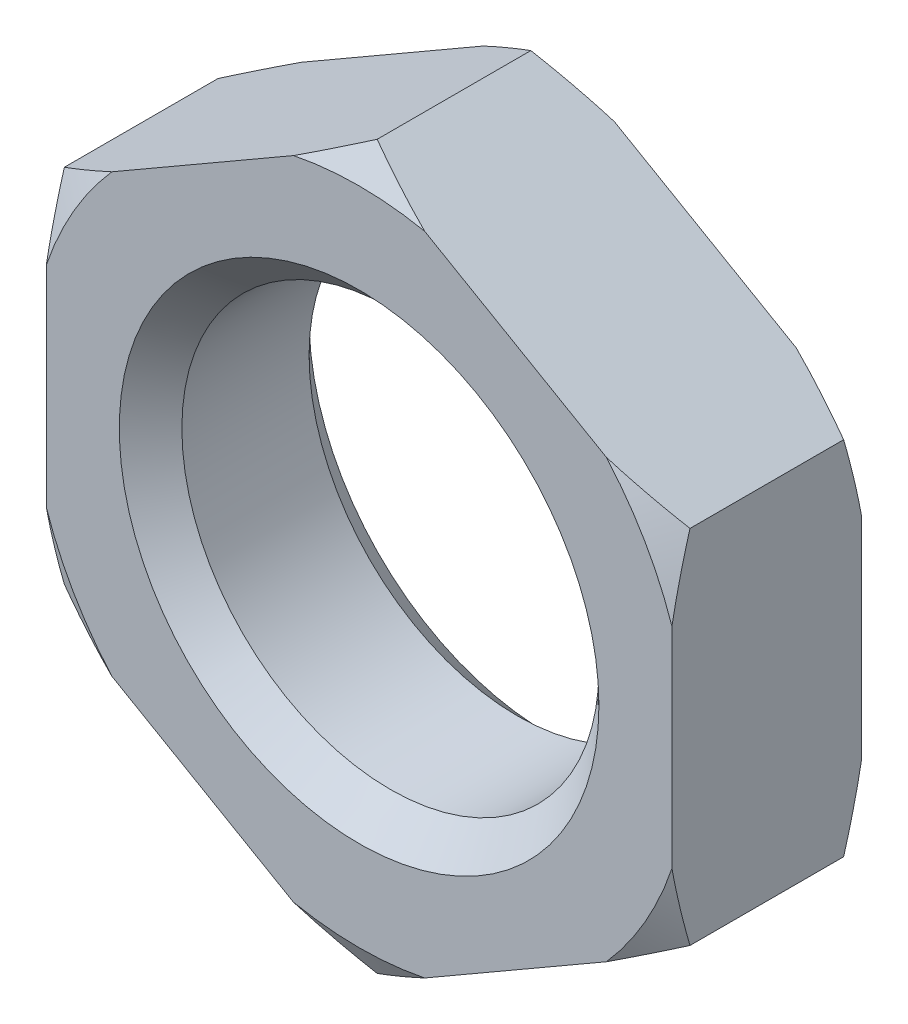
ISO-10303-21;
HEADER;
FILE_DESCRIPTION(('STEP AP214'),'2;1');
FILE_NAME('part.step','',(''),(''),'','','');
FILE_SCHEMA(('AUTOMOTIVE_DESIGN { 1 0 10303 214 1 1 1 1 }'));
ENDSEC;
DATA;
#1=APPLICATION_CONTEXT('core data for automotive mechanical design processes');
#2=APPLICATION_PROTOCOL_DEFINITION('international standard','automotive_design',2000,#1);
#3=PRODUCT_CONTEXT('',#1,'mechanical');
#4=PRODUCT('Part','Part','',(#3));
#5=PRODUCT_RELATED_PRODUCT_CATEGORY('part','',(#4));
#6=PRODUCT_DEFINITION_FORMATION('','',#4);
#7=PRODUCT_DEFINITION_CONTEXT('part definition',#1,'design');
#8=PRODUCT_DEFINITION('design','',#6,#7);
#9=PRODUCT_DEFINITION_SHAPE('','',#8);
#10=(LENGTH_UNIT() NAMED_UNIT(*) SI_UNIT(.MILLI.,.METRE.));
#11=(NAMED_UNIT(*) PLANE_ANGLE_UNIT() SI_UNIT($,.RADIAN.));
#12=(NAMED_UNIT(*) SI_UNIT($,.STERADIAN.) SOLID_ANGLE_UNIT());
#13=UNCERTAINTY_MEASURE_WITH_UNIT(LENGTH_MEASURE(1.E-05),#10,'distance_accuracy_value','');
#14=(GEOMETRIC_REPRESENTATION_CONTEXT(3) GLOBAL_UNCERTAINTY_ASSIGNED_CONTEXT((#13)) GLOBAL_UNIT_ASSIGNED_CONTEXT((#10,
#11,#12)) REPRESENTATION_CONTEXT('',''));
#15=CARTESIAN_POINT('',(0.,0.,0.));
#16=DIRECTION('',(0.,0.,1.));
#17=DIRECTION('',(1.,0.,0.));
#18=AXIS2_PLACEMENT_3D('',#15,#16,#17);
#19=CARTESIAN_POINT('',(0.,0.,-4.55));
#20=DIRECTION('',(0.,0.,1.));
#21=DIRECTION('',(1.,0.,0.));
#22=AXIS2_PLACEMENT_3D('',#19,#20,#21);
#23=PLANE('',#22);
#24=CARTESIAN_POINT('',(0.,0.,-4.55));
#25=DIRECTION('',(0.,0.,1.));
#26=DIRECTION('',(1.,0.,0.));
#27=AXIS2_PLACEMENT_3D('',#24,#25,#26);
#28=CIRCLE('',#27,11.5);
#29=CARTESIAN_POINT('',(11.5,0.,-4.55));
#30=VERTEX_POINT('',#29);
#31=EDGE_CURVE('E430',#30,#30,#28,.T.);
#32=ORIENTED_EDGE('',*,*,#31,.T.);
#33=EDGE_LOOP('',(#32));
#34=FACE_BOUND('',#33,.T.);
#35=DIRECTION('',(0.,1.,0.));
#36=VECTOR('',#35,1.);
#37=CARTESIAN_POINT('',(15.,-8.66025403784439,-4.55));
#38=LINE('',#37,#36);
#39=CARTESIAN_POINT('',(15.,-5.028764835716,-4.55));
#40=VERTEX_POINT('',#39);
#41=CARTESIAN_POINT('',(15.,5.028764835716,-4.55));
#42=VERTEX_POINT('',#41);
#43=EDGE_CURVE('E366',#40,#42,#38,.T.);
#44=ORIENTED_EDGE('',*,*,#43,.F.);
#45=CARTESIAN_POINT('',(0.,0.,-4.55));
#46=DIRECTION('',(0.,0.,-1.));
#47=DIRECTION('',(-1.,0.,0.));
#48=AXIS2_PLACEMENT_3D('',#45,#46,#47);
#49=CIRCLE('',#48,15.8205080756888);
#50=CARTESIAN_POINT('',(11.8550380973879,-10.4759986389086,-4.55));
#51=VERTEX_POINT('',#50);
#52=EDGE_CURVE('E353',#40,#51,#49,.T.);
#53=ORIENTED_EDGE('',*,*,#52,.T.);
#54=DIRECTION('',(0.866025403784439,0.5,0.));
#55=VECTOR('',#54,1.);
#56=CARTESIAN_POINT('',(0.,-17.3205080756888,-4.55));
#57=LINE('',#56,#55);
#58=CARTESIAN_POINT('',(3.14496190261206,-15.5047634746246,-4.55));
#59=VERTEX_POINT('',#58);
#60=EDGE_CURVE('E377',#59,#51,#57,.T.);
#61=ORIENTED_EDGE('',*,*,#60,.F.);
#62=CARTESIAN_POINT('',(-3.14496190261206,-15.5047634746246,-4.55));
#63=VERTEX_POINT('',#62);
#64=EDGE_CURVE('E347',#59,#63,#49,.T.);
#65=ORIENTED_EDGE('',*,*,#64,.T.);
#66=DIRECTION('',(0.866025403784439,-0.5,0.));
#67=VECTOR('',#66,1.);
#68=CARTESIAN_POINT('',(-15.,-8.66025403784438,-4.55));
#69=LINE('',#68,#67);
#70=CARTESIAN_POINT('',(-11.8550380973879,-10.4759986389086,-4.55));
#71=VERTEX_POINT('',#70);
#72=EDGE_CURVE('E383',#71,#63,#69,.T.);
#73=ORIENTED_EDGE('',*,*,#72,.F.);
#74=CARTESIAN_POINT('',(-15.,-5.028764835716,-4.55));
#75=VERTEX_POINT('',#74);
#76=EDGE_CURVE('E340',#71,#75,#49,.T.);
#77=ORIENTED_EDGE('',*,*,#76,.T.);
#78=DIRECTION('',(0.,-1.,0.));
#79=VECTOR('',#78,1.);
#80=CARTESIAN_POINT('',(-15.,8.66025403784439,-4.55));
#81=LINE('',#80,#79);
#82=CARTESIAN_POINT('',(-15.,5.028764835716,-4.55));
#83=VERTEX_POINT('',#82);
#84=EDGE_CURVE('E476',#83,#75,#81,.T.);
#85=ORIENTED_EDGE('',*,*,#84,.F.);
#86=CARTESIAN_POINT('',(-11.8550380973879,10.4759986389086,-4.55));
#87=VERTEX_POINT('',#86);
#88=EDGE_CURVE('E63',#83,#87,#49,.T.);
#89=ORIENTED_EDGE('',*,*,#88,.T.);
#90=DIRECTION('',(-0.866025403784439,-0.5,0.));
#91=VECTOR('',#90,1.);
#92=CARTESIAN_POINT('',(0.,17.3205080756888,-4.55));
#93=LINE('',#92,#91);
#94=CARTESIAN_POINT('',(-3.14496190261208,15.5047634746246,-4.55));
#95=VERTEX_POINT('',#94);
#96=EDGE_CURVE('E181',#95,#87,#93,.T.);
#97=ORIENTED_EDGE('',*,*,#96,.F.);
#98=CARTESIAN_POINT('',(3.14496190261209,15.5047634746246,-4.55));
#99=VERTEX_POINT('',#98);
#100=EDGE_CURVE('E55',#95,#99,#49,.T.);
#101=ORIENTED_EDGE('',*,*,#100,.T.);
#102=DIRECTION('',(-0.866025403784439,0.5,0.));
#103=VECTOR('',#102,1.);
#104=CARTESIAN_POINT('',(15.,8.66025403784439,-4.55));
#105=LINE('',#104,#103);
#106=CARTESIAN_POINT('',(11.8550380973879,10.4759986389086,-4.55));
#107=VERTEX_POINT('',#106);
#108=EDGE_CURVE('E367',#107,#99,#105,.T.);
#109=ORIENTED_EDGE('',*,*,#108,.F.);
#110=EDGE_CURVE('E344',#107,#42,#49,.T.);
#111=ORIENTED_EDGE('',*,*,#110,.T.);
#112=EDGE_LOOP('',(#44,#53,#61,#65,#73,#77,#85,#89,#97,#101,#109,#111));
#113=FACE_BOUND('',#112,.T.);
#114=ADVANCED_FACE('F39',(#34,#113),#23,.F.);
#115=CARTESIAN_POINT('',(0.,0.,4.55));
#116=DIRECTION('',(0.,0.,1.));
#117=DIRECTION('',(1.,0.,0.));
#118=AXIS2_PLACEMENT_3D('',#115,#116,#117);
#119=PLANE('',#118);
#120=CARTESIAN_POINT('',(0.,0.,4.55));
#121=DIRECTION('',(0.,0.,1.));
#122=DIRECTION('',(1.,0.,0.));
#123=AXIS2_PLACEMENT_3D('',#120,#121,#122);
#124=CIRCLE('',#123,11.5);
#125=CARTESIAN_POINT('',(11.5,0.,4.55));
#126=VERTEX_POINT('',#125);
#127=EDGE_CURVE('E11',#126,#126,#124,.F.);
#128=ORIENTED_EDGE('',*,*,#127,.T.);
#129=EDGE_LOOP('',(#128));
#130=FACE_BOUND('',#129,.T.);
#131=CARTESIAN_POINT('',(0.,0.,4.55));
#132=DIRECTION('',(0.,0.,-1.));
#133=DIRECTION('',(-1.,0.,0.));
#134=AXIS2_PLACEMENT_3D('',#131,#132,#133);
#135=CIRCLE('',#134,15.8205080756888);
#136=CARTESIAN_POINT('',(15.,-5.028764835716,4.55));
#137=VERTEX_POINT('',#136);
#138=CARTESIAN_POINT('',(11.8550380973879,-10.4759986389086,4.55));
#139=VERTEX_POINT('',#138);
#140=EDGE_CURVE('E314',#137,#139,#135,.T.);
#141=ORIENTED_EDGE('',*,*,#140,.F.);
#142=DIRECTION('',(0.,1.,0.));
#143=VECTOR('',#142,1.);
#144=CARTESIAN_POINT('',(15.,-8.66025403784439,4.55));
#145=LINE('',#144,#143);
#146=CARTESIAN_POINT('',(15.,5.028764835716,4.55));
#147=VERTEX_POINT('',#146);
#148=EDGE_CURVE('E391',#137,#147,#145,.T.);
#149=ORIENTED_EDGE('',*,*,#148,.T.);
#150=CARTESIAN_POINT('',(11.8550380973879,10.4759986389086,4.55));
#151=VERTEX_POINT('',#150);
#152=EDGE_CURVE('E306',#151,#147,#135,.T.);
#153=ORIENTED_EDGE('',*,*,#152,.F.);
#154=DIRECTION('',(-0.866025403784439,0.5,0.));
#155=VECTOR('',#154,1.);
#156=CARTESIAN_POINT('',(15.,8.66025403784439,4.55));
#157=LINE('',#156,#155);
#158=CARTESIAN_POINT('',(3.14496190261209,15.5047634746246,4.55));
#159=VERTEX_POINT('',#158);
#160=EDGE_CURVE('E376',#151,#159,#157,.T.);
#161=ORIENTED_EDGE('',*,*,#160,.T.);
#162=CARTESIAN_POINT('',(-3.14496190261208,15.5047634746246,4.55));
#163=VERTEX_POINT('',#162);
#164=EDGE_CURVE('E297',#163,#159,#135,.T.);
#165=ORIENTED_EDGE('',*,*,#164,.F.);
#166=DIRECTION('',(-0.866025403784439,-0.5,0.));
#167=VECTOR('',#166,1.);
#168=CARTESIAN_POINT('',(0.,17.3205080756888,4.55));
#169=LINE('',#168,#167);
#170=CARTESIAN_POINT('',(-11.8550380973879,10.4759986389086,4.55));
#171=VERTEX_POINT('',#170);
#172=EDGE_CURVE('E381',#163,#171,#169,.T.);
#173=ORIENTED_EDGE('',*,*,#172,.T.);
#174=CARTESIAN_POINT('',(-15.,5.028764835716,4.55));
#175=VERTEX_POINT('',#174);
#176=EDGE_CURVE('E295',#175,#171,#135,.T.);
#177=ORIENTED_EDGE('',*,*,#176,.F.);
#178=DIRECTION('',(0.,-1.,0.));
#179=VECTOR('',#178,1.);
#180=CARTESIAN_POINT('',(-15.,8.66025403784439,4.55));
#181=LINE('',#180,#179);
#182=CARTESIAN_POINT('',(-15.,-5.028764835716,4.55));
#183=VERTEX_POINT('',#182);
#184=EDGE_CURVE('E492',#175,#183,#181,.T.);
#185=ORIENTED_EDGE('',*,*,#184,.T.);
#186=CARTESIAN_POINT('',(-11.8550380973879,-10.4759986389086,4.55));
#187=VERTEX_POINT('',#186);
#188=EDGE_CURVE('E298',#187,#183,#135,.T.);
#189=ORIENTED_EDGE('',*,*,#188,.F.);
#190=DIRECTION('',(0.866025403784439,-0.5,0.));
#191=VECTOR('',#190,1.);
#192=CARTESIAN_POINT('',(-15.,-8.66025403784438,4.55));
#193=LINE('',#192,#191);
#194=CARTESIAN_POINT('',(-3.14496190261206,-15.5047634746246,4.55));
#195=VERTEX_POINT('',#194);
#196=EDGE_CURVE('E468',#187,#195,#193,.T.);
#197=ORIENTED_EDGE('',*,*,#196,.T.);
#198=CARTESIAN_POINT('',(3.14496190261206,-15.5047634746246,4.55));
#199=VERTEX_POINT('',#198);
#200=EDGE_CURVE('E308',#199,#195,#135,.T.);
#201=ORIENTED_EDGE('',*,*,#200,.F.);
#202=DIRECTION('',(0.866025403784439,0.5,0.));
#203=VECTOR('',#202,1.);
#204=CARTESIAN_POINT('',(0.,-17.3205080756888,4.55));
#205=LINE('',#204,#203);
#206=EDGE_CURVE('E466',#199,#139,#205,.T.);
#207=ORIENTED_EDGE('',*,*,#206,.T.);
#208=EDGE_LOOP('',(#141,#149,#153,#161,#165,#173,#177,#185,#189,#197,#201,#207));
#209=FACE_BOUND('',#208,.T.);
#210=ADVANCED_FACE('F421',(#130,#209),#119,.T.);
#211=CARTESIAN_POINT('',(15.,8.66025403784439,4.55));
#212=DIRECTION('',(-0.5,-0.866025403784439,0.));
#213=DIRECTION('',(0.866025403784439,-0.5,0.));
#214=AXIS2_PLACEMENT_3D('',#211,#212,#213);
#215=PLANE('',#214);
#216=DIRECTION('',(0.,0.,-1.));
#217=VECTOR('',#216,1.);
#218=CARTESIAN_POINT('',(15.,8.66025403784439,4.55));
#219=LINE('',#218,#217);
#220=CARTESIAN_POINT('',(15.,8.6602540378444,3.68397459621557));
#221=VERTEX_POINT('',#220);
#222=CARTESIAN_POINT('',(15.,8.66025403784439,-3.68397459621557));
#223=VERTEX_POINT('',#222);
#224=EDGE_CURVE('E387',#221,#223,#219,.T.);
#225=ORIENTED_EDGE('',*,*,#224,.T.);
#226=CARTESIAN_POINT('',(25.4054871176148,2.65264324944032,1.06362737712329));
#227=CARTESIAN_POINT('',(25.1698789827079,2.78867166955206,0.936492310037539));
#228=CARTESIAN_POINT('',(24.9339850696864,2.92486508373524,0.810063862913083));
#229=CARTESIAN_POINT('',(24.4615756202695,3.19761080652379,0.558758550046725));
#230=CARTESIAN_POINT('',(24.2250600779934,3.33416311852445,0.433881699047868));
#231=CARTESIAN_POINT('',(23.5144572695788,3.74442984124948,0.0617606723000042));
#232=CARTESIAN_POINT('',(23.0393688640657,4.01872226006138,-0.182944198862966));
#233=CARTESIAN_POINT('',(22.0845675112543,4.56997707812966,-0.664978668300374));
#234=CARTESIAN_POINT('',(21.6048446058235,4.84694522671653,-0.902282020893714));
#235=CARTESIAN_POINT('',(20.6418020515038,5.40295810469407,-1.36693100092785));
#236=CARTESIAN_POINT('',(20.1584825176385,5.68200276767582,-1.59427694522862));
#237=CARTESIAN_POINT('',(19.1753631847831,6.24960697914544,-2.04243672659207));
#238=CARTESIAN_POINT('',(18.6754562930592,6.53822835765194,-2.26293867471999));
#239=CARTESIAN_POINT('',(17.6705925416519,7.11838671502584,-2.68821323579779));
#240=CARTESIAN_POINT('',(17.1656354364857,7.40992383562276,-2.89298507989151));
#241=CARTESIAN_POINT('',(16.1505790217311,7.99596692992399,-3.2828931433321));
#242=CARTESIAN_POINT('',(15.6404852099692,8.2904697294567,-3.46804832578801));
#243=CARTESIAN_POINT('',(14.6142395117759,8.88297295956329,-3.81445421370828));
#244=CARTESIAN_POINT('',(14.0980884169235,9.18097293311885,-3.97570800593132));
#245=CARTESIAN_POINT('',(13.2212872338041,9.6871943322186,-4.22345279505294));
#246=CARTESIAN_POINT('',(12.8622573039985,9.89448035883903,-4.31758938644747));
#247=CARTESIAN_POINT('',(12.1414059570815,10.3106640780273,-4.49026786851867));
#248=CARTESIAN_POINT('',(11.779584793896,10.5195616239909,-4.5688111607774));
#249=CARTESIAN_POINT('',(11.0535030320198,10.9387651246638,-4.7085356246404));
#250=CARTESIAN_POINT('',(10.6892430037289,11.1490707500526,-4.76972072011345));
#251=CARTESIAN_POINT('',(9.95869954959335,11.5708502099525,-4.87317708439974));
#252=CARTESIAN_POINT('',(9.59241614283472,11.7823240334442,-4.91544853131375));
#253=CARTESIAN_POINT('',(8.86276685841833,12.2035872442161,-4.97949581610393));
#254=CARTESIAN_POINT('',(8.49941637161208,12.4133677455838,-5.0015035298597));
#255=CARTESIAN_POINT('',(7.7722180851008,12.8332158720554,-5.02520318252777));
#256=CARTESIAN_POINT('',(7.408370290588,13.0432834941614,-5.02689533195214));
#257=CARTESIAN_POINT('',(6.6810348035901,13.4632108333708,-5.00991062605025));
#258=CARTESIAN_POINT('',(6.3175471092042,13.6730705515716,-4.99123387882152));
#259=CARTESIAN_POINT('',(5.59170319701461,14.0921367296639,-4.93407619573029));
#260=CARTESIAN_POINT('',(5.22934716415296,14.3013430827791,-4.8955921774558));
#261=CARTESIAN_POINT('',(4.37299758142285,14.7957567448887,-4.78221327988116));
#262=CARTESIAN_POINT('',(3.87981186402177,15.0804976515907,-4.69912026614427));
#263=CARTESIAN_POINT('',(2.89816853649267,15.6472496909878,-4.50168390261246));
#264=CARTESIAN_POINT('',(2.4097116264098,15.9292604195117,-4.38733599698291));
#265=CARTESIAN_POINT('',(1.43758265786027,16.4905193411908,-4.13170701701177));
#266=CARTESIAN_POINT('',(0.953916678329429,16.7697640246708,-3.99039543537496));
#267=CARTESIAN_POINT('',(-0.00798269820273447,17.325116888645,-3.68529050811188));
#268=CARTESIAN_POINT('',(-0.486216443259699,17.6012252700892,-3.52149861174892));
#269=CARTESIAN_POINT('',(-1.44323792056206,18.15376187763,-3.17326449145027));
#270=CARTESIAN_POINT('',(-1.9219644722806,18.4301547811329,-2.98859964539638));
#271=CARTESIAN_POINT('',(-2.87434620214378,18.9800126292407,-2.60378815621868));
#272=CARTESIAN_POINT('',(-3.34800451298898,19.2534793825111,-2.40365179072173));
#273=CARTESIAN_POINT('',(-4.29097791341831,19.7979053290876,-1.99065525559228));
#274=CARTESIAN_POINT('',(-4.7602941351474,20.0688651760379,-1.77779851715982));
#275=CARTESIAN_POINT('',(-5.69530300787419,20.6086928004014,-1.34155460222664));
#276=CARTESIAN_POINT('',(-6.16099516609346,20.8775602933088,-1.11816602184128));
#277=CARTESIAN_POINT('',(-6.94444044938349,21.3298826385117,-0.733724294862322));
#278=CARTESIAN_POINT('',(-7.2630384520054,21.5138252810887,-0.574957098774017));
#279=CARTESIAN_POINT('',(-7.8988498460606,21.8809111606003,-0.253800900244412));
#280=CARTESIAN_POINT('',(-8.21606328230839,22.0640544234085,-0.0914120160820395));
#281=CARTESIAN_POINT('',(-8.84593418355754,22.4277105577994,0.234847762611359));
#282=CARTESIAN_POINT('',(-9.15860459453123,22.6082309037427,0.398685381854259));
#283=CARTESIAN_POINT('',(-9.78284474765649,22.9686361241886,0.729150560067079));
#284=CARTESIAN_POINT('',(-10.0944144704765,23.14852098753,0.895778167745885));
#285=CARTESIAN_POINT('',(-10.4054871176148,23.3281188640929,1.06362737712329));
#286=B_SPLINE_CURVE_WITH_KNOTS('',3,(#226,#227,#228,#229,#230,#231,#232,#233,#234,#235,#236,
#237,#238,#239,#240,#241,#242,#243,#244,#245,#246,#247,#248,#249,#250,#251,#252,#253,#254,#255,
#256,#257,#258,#259,#260,#261,#262,#263,#264,#265,#266,#267,#268,#269,#270,#271,#272,#273,#274,
#275,#276,#277,#278,#279,#280,#281,#282,#283,#284,#285),.UNSPECIFIED.,.F.,.F.,(4,2,2,2,2,2,2,2,
2,2,2,2,2,2,2,2,2,2,2,2,2,2,2,2,2,2,2,2,2,4),(0.,0.900888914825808,1.8017863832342,
3.60379186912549,5.41159178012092,7.21933412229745,9.07292299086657,10.9266024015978,
12.7784732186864,14.6301046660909,15.9052271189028,17.1802349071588,18.4549542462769,
19.7296615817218,20.9895944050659,22.2495141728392,23.5094272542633,24.7695364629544,
26.4950276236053,28.2207704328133,29.9484774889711,31.6760732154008,33.4242353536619,
35.1712460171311,36.9177875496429,38.6645625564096,39.8665916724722,41.0685815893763,
42.2579971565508,43.447433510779),.UNSPECIFIED.);
#287=EDGE_CURVE('E318',#223,#107,#286,.T.);
#288=ORIENTED_EDGE('',*,*,#287,.T.);
#289=ORIENTED_EDGE('',*,*,#108,.T.);
#290=CARTESIAN_POINT('',(0.,17.3205080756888,-3.68397459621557));
#291=VERTEX_POINT('',#290);
#292=EDGE_CURVE('E309',#99,#291,#286,.T.);
#293=ORIENTED_EDGE('',*,*,#292,.T.);
#294=DIRECTION('',(0.,0.,-1.));
#295=VECTOR('',#294,1.);
#296=CARTESIAN_POINT('',(0.,17.3205080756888,4.55));
#297=LINE('',#296,#295);
#298=CARTESIAN_POINT('',(0.,17.3205080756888,3.68397459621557));
#299=VERTEX_POINT('',#298);
#300=EDGE_CURVE('E190',#299,#291,#297,.T.);
#301=ORIENTED_EDGE('',*,*,#300,.F.);
#302=CARTESIAN_POINT('',(-10.4054871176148,23.3281188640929,-1.0636273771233));
#303=CARTESIAN_POINT('',(-10.1698789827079,23.1920904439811,-0.936492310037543));
#304=CARTESIAN_POINT('',(-9.93398506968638,23.0558970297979,-0.810063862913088));
#305=CARTESIAN_POINT('',(-9.46157562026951,22.7831513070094,-0.558758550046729));
#306=CARTESIAN_POINT('',(-9.22506007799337,22.6465989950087,-0.433881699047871));
#307=CARTESIAN_POINT('',(-8.51445726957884,22.2363322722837,-0.061760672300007));
#308=CARTESIAN_POINT('',(-8.03936886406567,21.9620398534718,0.182944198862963));
#309=CARTESIAN_POINT('',(-7.08456751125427,21.4107850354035,0.664978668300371));
#310=CARTESIAN_POINT('',(-6.60484460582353,21.1338168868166,0.902282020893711));
#311=CARTESIAN_POINT('',(-5.64180205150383,20.5778040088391,1.36693100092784));
#312=CARTESIAN_POINT('',(-5.15848251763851,20.2987593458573,1.59427694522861));
#313=CARTESIAN_POINT('',(-4.17536318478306,19.7311551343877,2.04243672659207));
#314=CARTESIAN_POINT('',(-3.67545629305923,19.4425337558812,2.26293867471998));
#315=CARTESIAN_POINT('',(-2.67059254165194,18.8623753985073,2.68821323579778));
#316=CARTESIAN_POINT('',(-2.16563543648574,18.5708382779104,2.8929850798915));
#317=CARTESIAN_POINT('',(-1.15057902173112,17.9847951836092,3.2828931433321));
#318=CARTESIAN_POINT('',(-0.640485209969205,17.6902923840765,3.468048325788));
#319=CARTESIAN_POINT('',(0.385760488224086,17.0977891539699,3.81445421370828));
#320=CARTESIAN_POINT('',(0.901911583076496,16.7997891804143,3.97570800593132));
#321=CARTESIAN_POINT('',(1.77871276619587,16.2935677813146,4.22345279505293));
#322=CARTESIAN_POINT('',(2.13774269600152,16.0862817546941,4.31758938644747));
#323=CARTESIAN_POINT('',(2.85859404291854,15.6700980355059,4.49026786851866));
#324=CARTESIAN_POINT('',(3.22041520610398,15.4612004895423,4.5688111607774));
#325=CARTESIAN_POINT('',(3.94649696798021,15.0419969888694,4.7085356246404));
#326=CARTESIAN_POINT('',(4.31075699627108,14.8316913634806,4.76972072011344));
#327=CARTESIAN_POINT('',(5.04130045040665,14.4099119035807,4.87317708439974));
#328=CARTESIAN_POINT('',(5.40758385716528,14.1984380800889,4.91544853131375));
#329=CARTESIAN_POINT('',(6.13723314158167,13.7771748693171,4.97949581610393));
#330=CARTESIAN_POINT('',(6.50058362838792,13.5673943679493,5.0015035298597));
#331=CARTESIAN_POINT('',(7.2277819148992,13.1475462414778,5.02520318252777));
#332=CARTESIAN_POINT('',(7.591629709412,12.9374786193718,5.02689533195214));
#333=CARTESIAN_POINT('',(8.3189651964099,12.5175512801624,5.00991062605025));
#334=CARTESIAN_POINT('',(8.6824528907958,12.3076915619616,4.99123387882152));
#335=CARTESIAN_POINT('',(9.40829680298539,11.8886253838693,4.93407619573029));
#336=CARTESIAN_POINT('',(9.77065283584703,11.6794190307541,4.8955921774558));
#337=CARTESIAN_POINT('',(10.6270024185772,11.1850053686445,4.78221327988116));
#338=CARTESIAN_POINT('',(11.1201881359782,10.9002644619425,4.69912026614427));
#339=CARTESIAN_POINT('',(12.1018314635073,10.3335124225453,4.50168390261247));
#340=CARTESIAN_POINT('',(12.5902883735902,10.0515016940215,4.38733599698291));
#341=CARTESIAN_POINT('',(13.5624173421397,9.49024277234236,4.13170701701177));
#342=CARTESIAN_POINT('',(14.0460833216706,9.21099808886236,3.99039543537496));
#343=CARTESIAN_POINT('',(15.0079826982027,8.65564522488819,3.68529050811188));
#344=CARTESIAN_POINT('',(15.4862164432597,8.37953684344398,3.52149861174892));
#345=CARTESIAN_POINT('',(16.4432379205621,7.82700023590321,3.17326449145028));
#346=CARTESIAN_POINT('',(16.9219644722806,7.55060733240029,2.98859964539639));
#347=CARTESIAN_POINT('',(17.8743462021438,7.0007494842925,2.60378815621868));
#348=CARTESIAN_POINT('',(18.348004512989,6.72728273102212,2.40365179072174));
#349=CARTESIAN_POINT('',(19.2909779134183,6.18285678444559,1.99065525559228));
#350=CARTESIAN_POINT('',(19.7602941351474,5.91189693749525,1.77779851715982));
#351=CARTESIAN_POINT('',(20.6953030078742,5.37206931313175,1.34155460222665));
#352=CARTESIAN_POINT('',(21.1609951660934,5.10320182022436,1.11816602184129));
#353=CARTESIAN_POINT('',(21.9444404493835,4.65087947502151,0.733724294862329));
#354=CARTESIAN_POINT('',(22.2630384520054,4.46693683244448,0.574957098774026));
#355=CARTESIAN_POINT('',(22.8988498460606,4.09985095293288,0.253800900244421));
#356=CARTESIAN_POINT('',(23.2160632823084,3.91670769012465,0.0914120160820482));
#357=CARTESIAN_POINT('',(23.8459341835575,3.55305155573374,-0.23484776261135));
#358=CARTESIAN_POINT('',(24.1586045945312,3.37253120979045,-0.39868538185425));
#359=CARTESIAN_POINT('',(24.7828447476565,3.0121259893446,-0.729150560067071));
#360=CARTESIAN_POINT('',(25.0944144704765,2.83224112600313,-0.895778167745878));
#361=CARTESIAN_POINT('',(25.4054871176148,2.65264324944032,-1.06362737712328));
#362=B_SPLINE_CURVE_WITH_KNOTS('',3,(#302,#303,#304,#305,#306,#307,#308,#309,#310,#311,#312,
#313,#314,#315,#316,#317,#318,#319,#320,#321,#322,#323,#324,#325,#326,#327,#328,#329,#330,#331,
#332,#333,#334,#335,#336,#337,#338,#339,#340,#341,#342,#343,#344,#345,#346,#347,#348,#349,#350,
#351,#352,#353,#354,#355,#356,#357,#358,#359,#360,#361),.UNSPECIFIED.,.F.,.F.,(4,2,2,2,2,2,2,2,
2,2,2,2,2,2,2,2,2,2,2,2,2,2,2,2,2,2,2,2,2,4),(0.,0.900888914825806,1.8017863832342,
3.60379186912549,5.41159178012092,7.21933412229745,9.07292299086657,10.9266024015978,
12.7784732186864,14.6301046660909,15.9052271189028,17.1802349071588,18.4549542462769,
19.7296615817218,20.9895944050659,22.2495141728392,23.5094272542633,24.7695364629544,
26.4950276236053,28.2207704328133,29.9484774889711,31.6760732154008,33.4242353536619,
35.1712460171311,36.917787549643,38.6645625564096,39.8665916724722,41.0685815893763,
42.2579971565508,43.447433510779),.UNSPECIFIED.);
#363=EDGE_CURVE('E474',#299,#159,#362,.T.);
#364=ORIENTED_EDGE('',*,*,#363,.T.);
#365=ORIENTED_EDGE('',*,*,#160,.F.);
#366=EDGE_CURVE('E248',#151,#221,#362,.T.);
#367=ORIENTED_EDGE('',*,*,#366,.T.);
#368=EDGE_LOOP('',(#225,#288,#289,#293,#301,#364,#365,#367));
#369=FACE_BOUND('',#368,.T.);
#370=ADVANCED_FACE('F426',(#369),#215,.F.);
#371=CARTESIAN_POINT('',(0.,17.3205080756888,4.55));
#372=DIRECTION('',(0.5,-0.866025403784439,0.));
#373=DIRECTION('',(0.866025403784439,0.5,0.));
#374=AXIS2_PLACEMENT_3D('',#371,#372,#373);
#375=PLANE('',#374);
#376=ORIENTED_EDGE('',*,*,#300,.T.);
#377=CARTESIAN_POINT('',(10.4054871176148,23.3281188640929,1.0636273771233));
#378=CARTESIAN_POINT('',(10.1698789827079,23.1920904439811,0.936492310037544));
#379=CARTESIAN_POINT('',(9.93398506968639,23.0558970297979,0.810063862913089));
#380=CARTESIAN_POINT('',(9.46157562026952,22.7831513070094,0.558758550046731));
#381=CARTESIAN_POINT('',(9.22506007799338,22.6465989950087,0.433881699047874));
#382=CARTESIAN_POINT('',(8.51445726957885,22.2363322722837,0.0617606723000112));
#383=CARTESIAN_POINT('',(8.03936886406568,21.9620398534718,-0.18294419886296));
#384=CARTESIAN_POINT('',(7.08456751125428,21.4107850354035,-0.66497866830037));
#385=CARTESIAN_POINT('',(6.60484460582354,21.1338168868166,-0.902282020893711));
#386=CARTESIAN_POINT('',(5.64180205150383,20.5778040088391,-1.36693100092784));
#387=CARTESIAN_POINT('',(5.15848251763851,20.2987593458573,-1.59427694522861));
#388=CARTESIAN_POINT('',(4.17536318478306,19.7311551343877,-2.04243672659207));
#389=CARTESIAN_POINT('',(3.67545629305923,19.4425337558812,-2.26293867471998));
#390=CARTESIAN_POINT('',(2.67059254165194,18.8623753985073,-2.68821323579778));
#391=CARTESIAN_POINT('',(2.16563543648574,18.5708382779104,-2.8929850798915));
#392=CARTESIAN_POINT('',(1.15057902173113,17.9847951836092,-3.2828931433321));
#393=CARTESIAN_POINT('',(0.64048520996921,17.6902923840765,-3.468048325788));
#394=CARTESIAN_POINT('',(-0.385760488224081,17.0977891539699,-3.81445421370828));
#395=CARTESIAN_POINT('',(-0.90191158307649,16.7997891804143,-3.97570800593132));
#396=CARTESIAN_POINT('',(-1.77871276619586,16.2935677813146,-4.22345279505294));
#397=CARTESIAN_POINT('',(-2.13774269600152,16.0862817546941,-4.31758938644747));
#398=CARTESIAN_POINT('',(-2.85859404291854,15.6700980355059,-4.49026786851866));
#399=CARTESIAN_POINT('',(-3.22041520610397,15.4612004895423,-4.5688111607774));
#400=CARTESIAN_POINT('',(-3.94649696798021,15.0419969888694,-4.7085356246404));
#401=CARTESIAN_POINT('',(-4.31075699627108,14.8316913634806,-4.76972072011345));
#402=CARTESIAN_POINT('',(-5.04130045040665,14.4099119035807,-4.87317708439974));
#403=CARTESIAN_POINT('',(-5.40758385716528,14.1984380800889,-4.91544853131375));
#404=CARTESIAN_POINT('',(-6.13723314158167,13.7771748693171,-4.97949581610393));
#405=CARTESIAN_POINT('',(-6.50058362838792,13.5673943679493,-5.0015035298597));
#406=CARTESIAN_POINT('',(-7.2277819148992,13.1475462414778,-5.02520318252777));
#407=CARTESIAN_POINT('',(-7.591629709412,12.9374786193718,-5.02689533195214));
#408=CARTESIAN_POINT('',(-8.31896519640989,12.5175512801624,-5.00991062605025));
#409=CARTESIAN_POINT('',(-8.68245289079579,12.3076915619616,-4.99123387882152));
#410=CARTESIAN_POINT('',(-9.40829680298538,11.8886253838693,-4.93407619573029));
#411=CARTESIAN_POINT('',(-9.77065283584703,11.6794190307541,-4.8955921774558));
#412=CARTESIAN_POINT('',(-10.6270024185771,11.1850053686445,-4.78221327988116));
#413=CARTESIAN_POINT('',(-11.1201881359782,10.9002644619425,-4.69912026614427));
#414=CARTESIAN_POINT('',(-12.1018314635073,10.3335124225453,-4.50168390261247));
#415=CARTESIAN_POINT('',(-12.5902883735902,10.0515016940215,-4.38733599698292));
#416=CARTESIAN_POINT('',(-13.5624173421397,9.49024277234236,-4.13170701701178));
#417=CARTESIAN_POINT('',(-14.0460833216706,9.21099808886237,-3.99039543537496));
#418=CARTESIAN_POINT('',(-15.0079826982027,8.65564522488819,-3.68529050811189));
#419=CARTESIAN_POINT('',(-15.4862164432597,8.37953684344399,-3.52149861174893));
#420=CARTESIAN_POINT('',(-16.443237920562,7.82700023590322,-3.17326449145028));
#421=CARTESIAN_POINT('',(-16.9219644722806,7.5506073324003,-2.98859964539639));
#422=CARTESIAN_POINT('',(-17.8743462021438,7.00074948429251,-2.60378815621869));
#423=CARTESIAN_POINT('',(-18.348004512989,6.72728273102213,-2.40365179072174));
#424=CARTESIAN_POINT('',(-19.2909779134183,6.1828567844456,-1.99065525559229));
#425=CARTESIAN_POINT('',(-19.7602941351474,5.91189693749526,-1.77779851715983));
#426=CARTESIAN_POINT('',(-20.6953030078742,5.37206931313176,-1.34155460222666));
#427=CARTESIAN_POINT('',(-21.1609951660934,5.10320182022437,-1.11816602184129));
#428=CARTESIAN_POINT('',(-21.9444404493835,4.65087947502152,-0.733724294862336));
#429=CARTESIAN_POINT('',(-22.2630384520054,4.46693683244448,-0.574957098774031));
#430=CARTESIAN_POINT('',(-22.8988498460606,4.09985095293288,-0.253800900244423));
#431=CARTESIAN_POINT('',(-23.2160632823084,3.91670769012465,-0.0914120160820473));
#432=CARTESIAN_POINT('',(-23.8459341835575,3.55305155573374,0.234847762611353));
#433=CARTESIAN_POINT('',(-24.1586045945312,3.37253120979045,0.398685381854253));
#434=CARTESIAN_POINT('',(-24.7828447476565,3.0121259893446,0.729150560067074));
#435=CARTESIAN_POINT('',(-25.0944144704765,2.83224112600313,0.895778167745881));
#436=CARTESIAN_POINT('',(-25.4054871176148,2.65264324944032,1.06362737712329));
#437=B_SPLINE_CURVE_WITH_KNOTS('',3,(#377,#378,#379,#380,#381,#382,#383,#384,#385,#386,#387,
#388,#389,#390,#391,#392,#393,#394,#395,#396,#397,#398,#399,#400,#401,#402,#403,#404,#405,#406,
#407,#408,#409,#410,#411,#412,#413,#414,#415,#416,#417,#418,#419,#420,#421,#422,#423,#424,#425,
#426,#427,#428,#429,#430,#431,#432,#433,#434,#435,#436),.UNSPECIFIED.,.F.,.F.,(4,2,2,2,2,2,2,2,
2,2,2,2,2,2,2,2,2,2,2,2,2,2,2,2,2,2,2,2,2,4),(0.,0.900888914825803,1.8017863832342,
3.60379186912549,5.41159178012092,7.21933412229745,9.07292299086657,10.9266024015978,
12.7784732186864,14.6301046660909,15.9052271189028,17.1802349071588,18.4549542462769,
19.7296615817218,20.9895944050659,22.2495141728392,23.5094272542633,24.7695364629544,
26.4950276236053,28.2207704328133,29.9484774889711,31.6760732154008,33.4242353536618,
35.1712460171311,36.9177875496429,38.6645625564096,39.8665916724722,41.0685815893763,
42.2579971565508,43.447433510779),.UNSPECIFIED.);
#438=EDGE_CURVE('E183',#291,#95,#437,.T.);
#439=ORIENTED_EDGE('',*,*,#438,.T.);
#440=ORIENTED_EDGE('',*,*,#96,.T.);
#441=CARTESIAN_POINT('',(-15.,8.66025403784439,-3.68397459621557));
#442=VERTEX_POINT('',#441);
#443=EDGE_CURVE('E165',#87,#442,#437,.T.);
#444=ORIENTED_EDGE('',*,*,#443,.T.);
#445=DIRECTION('',(0.,0.,-1.));
#446=VECTOR('',#445,1.);
#447=CARTESIAN_POINT('',(-15.,8.66025403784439,4.55));
#448=LINE('',#447,#446);
#449=CARTESIAN_POINT('',(-15.,8.66025403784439,3.68397459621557));
#450=VERTEX_POINT('',#449);
#451=EDGE_CURVE('E179',#450,#442,#448,.T.);
#452=ORIENTED_EDGE('',*,*,#451,.F.);
#453=CARTESIAN_POINT('',(-25.4054871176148,2.65264324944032,-1.0636273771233));
#454=CARTESIAN_POINT('',(-25.1698789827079,2.78867166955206,-0.936492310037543));
#455=CARTESIAN_POINT('',(-24.9339850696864,2.92486508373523,-0.810063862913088));
#456=CARTESIAN_POINT('',(-24.4615756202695,3.19761080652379,-0.558758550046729));
#457=CARTESIAN_POINT('',(-24.2250600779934,3.33416311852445,-0.433881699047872));
#458=CARTESIAN_POINT('',(-23.5144572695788,3.74442984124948,-0.0617606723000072));
#459=CARTESIAN_POINT('',(-23.0393688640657,4.01872226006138,0.182944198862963));
#460=CARTESIAN_POINT('',(-22.0845675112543,4.56997707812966,0.664978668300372));
#461=CARTESIAN_POINT('',(-21.6048446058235,4.84694522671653,0.902282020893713));
#462=CARTESIAN_POINT('',(-20.6418020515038,5.40295810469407,1.36693100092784));
#463=CARTESIAN_POINT('',(-20.1584825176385,5.68200276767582,1.59427694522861));
#464=CARTESIAN_POINT('',(-19.1753631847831,6.24960697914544,2.04243672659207));
#465=CARTESIAN_POINT('',(-18.6754562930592,6.53822835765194,2.26293867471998));
#466=CARTESIAN_POINT('',(-17.6705925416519,7.11838671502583,2.68821323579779));
#467=CARTESIAN_POINT('',(-17.1656354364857,7.40992383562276,2.8929850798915));
#468=CARTESIAN_POINT('',(-16.1505790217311,7.99596692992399,3.2828931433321));
#469=CARTESIAN_POINT('',(-15.6404852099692,8.29046972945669,3.46804832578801));
#470=CARTESIAN_POINT('',(-14.6142395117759,8.88297295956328,3.81445421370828));
#471=CARTESIAN_POINT('',(-14.0980884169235,9.18097293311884,3.97570800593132));
#472=CARTESIAN_POINT('',(-13.2212872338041,9.6871943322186,4.22345279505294));
#473=CARTESIAN_POINT('',(-12.8622573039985,9.89448035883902,4.31758938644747));
#474=CARTESIAN_POINT('',(-12.1414059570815,10.3106640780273,4.49026786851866));
#475=CARTESIAN_POINT('',(-11.779584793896,10.5195616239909,4.5688111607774));
#476=CARTESIAN_POINT('',(-11.0535030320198,10.9387651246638,4.7085356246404));
#477=CARTESIAN_POINT('',(-10.6892430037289,11.1490707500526,4.76972072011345));
#478=CARTESIAN_POINT('',(-9.95869954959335,11.5708502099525,4.87317708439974));
#479=CARTESIAN_POINT('',(-9.59241614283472,11.7823240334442,4.91544853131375));
#480=CARTESIAN_POINT('',(-8.86276685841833,12.2035872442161,4.97949581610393));
#481=CARTESIAN_POINT('',(-8.49941637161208,12.4133677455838,5.0015035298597));
#482=CARTESIAN_POINT('',(-7.7722180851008,12.8332158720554,5.02520318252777));
#483=CARTESIAN_POINT('',(-7.408370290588,13.0432834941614,5.02689533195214));
#484=CARTESIAN_POINT('',(-6.68103480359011,13.4632108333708,5.00991062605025));
#485=CARTESIAN_POINT('',(-6.31754710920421,13.6730705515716,4.99123387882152));
#486=CARTESIAN_POINT('',(-5.59170319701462,14.0921367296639,4.93407619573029));
#487=CARTESIAN_POINT('',(-5.22934716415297,14.3013430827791,4.8955921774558));
#488=CARTESIAN_POINT('',(-4.37299758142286,14.7957567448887,4.78221327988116));
#489=CARTESIAN_POINT('',(-3.87981186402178,15.0804976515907,4.69912026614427));
#490=CARTESIAN_POINT('',(-2.89816853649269,15.6472496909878,4.50168390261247));
#491=CARTESIAN_POINT('',(-2.40971162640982,15.9292604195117,4.38733599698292));
#492=CARTESIAN_POINT('',(-1.43758265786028,16.4905193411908,4.13170701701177));
#493=CARTESIAN_POINT('',(-0.953916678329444,16.7697640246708,3.99039543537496));
#494=CARTESIAN_POINT('',(0.00798269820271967,17.325116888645,3.68529050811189));
#495=CARTESIAN_POINT('',(0.486216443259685,17.6012252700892,3.52149861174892));
#496=CARTESIAN_POINT('',(1.44323792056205,18.15376187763,3.17326449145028));
#497=CARTESIAN_POINT('',(1.92196447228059,18.4301547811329,2.98859964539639));
#498=CARTESIAN_POINT('',(2.87434620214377,18.9800126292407,2.60378815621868));
#499=CARTESIAN_POINT('',(3.34800451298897,19.253479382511,2.40365179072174));
#500=CARTESIAN_POINT('',(4.2909779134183,19.7979053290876,1.99065525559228));
#501=CARTESIAN_POINT('',(4.76029413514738,20.0688651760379,1.77779851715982));
#502=CARTESIAN_POINT('',(5.69530300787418,20.6086928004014,1.34155460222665));
#503=CARTESIAN_POINT('',(6.16099516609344,20.8775602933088,1.11816602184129));
#504=CARTESIAN_POINT('',(6.94444044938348,21.3298826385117,0.733724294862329));
#505=CARTESIAN_POINT('',(7.26303845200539,21.5138252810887,0.574957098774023));
#506=CARTESIAN_POINT('',(7.8988498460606,21.8809111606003,0.253800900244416));
#507=CARTESIAN_POINT('',(8.21606328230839,22.0640544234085,0.0914120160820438));
#508=CARTESIAN_POINT('',(8.84593418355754,22.4277105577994,-0.234847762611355));
#509=CARTESIAN_POINT('',(9.15860459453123,22.6082309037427,-0.398685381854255));
#510=CARTESIAN_POINT('',(9.78284474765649,22.9686361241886,-0.729150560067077));
#511=CARTESIAN_POINT('',(10.0944144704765,23.14852098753,-0.895778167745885));
#512=CARTESIAN_POINT('',(10.4054871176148,23.3281188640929,-1.06362737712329));
#513=B_SPLINE_CURVE_WITH_KNOTS('',3,(#453,#454,#455,#456,#457,#458,#459,#460,#461,#462,#463,
#464,#465,#466,#467,#468,#469,#470,#471,#472,#473,#474,#475,#476,#477,#478,#479,#480,#481,#482,
#483,#484,#485,#486,#487,#488,#489,#490,#491,#492,#493,#494,#495,#496,#497,#498,#499,#500,#501,
#502,#503,#504,#505,#506,#507,#508,#509,#510,#511,#512),.UNSPECIFIED.,.F.,.F.,(4,2,2,2,2,2,2,2,
2,2,2,2,2,2,2,2,2,2,2,2,2,2,2,2,2,2,2,2,2,4),(0.,0.900888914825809,1.8017863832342,
3.60379186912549,5.41159178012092,7.21933412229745,9.07292299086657,10.9266024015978,
12.7784732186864,14.6301046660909,15.9052271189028,17.1802349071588,18.4549542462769,
19.7296615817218,20.9895944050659,22.2495141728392,23.5094272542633,24.7695364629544,
26.4950276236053,28.2207704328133,29.9484774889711,31.6760732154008,33.4242353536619,
35.1712460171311,36.9177875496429,38.6645625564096,39.8665916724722,41.0685815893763,
42.2579971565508,43.447433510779),.UNSPECIFIED.);
#514=EDGE_CURVE('E268',#450,#171,#513,.T.);
#515=ORIENTED_EDGE('',*,*,#514,.T.);
#516=ORIENTED_EDGE('',*,*,#172,.F.);
#517=EDGE_CURVE('E483',#163,#299,#513,.T.);
#518=ORIENTED_EDGE('',*,*,#517,.T.);
#519=EDGE_LOOP('',(#376,#439,#440,#444,#452,#515,#516,#518));
#520=FACE_BOUND('',#519,.T.);
#521=ADVANCED_FACE('F177',(#520),#375,.F.);
#522=CARTESIAN_POINT('',(-15.,8.66025403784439,4.55));
#523=DIRECTION('',(1.,0.,0.));
#524=DIRECTION('',(0.,0.,-1.));
#525=AXIS2_PLACEMENT_3D('',#522,#523,#524);
#526=PLANE('',#525);
#527=ORIENTED_EDGE('',*,*,#451,.T.);
#528=CARTESIAN_POINT('',(-15.,19.0657411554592,0.322006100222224));
#529=CARTESIAN_POINT('',(-15.,18.7948149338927,0.199075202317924));
#530=CARTESIAN_POINT('',(-15.,18.5235140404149,0.0769706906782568));
#531=CARTESIAN_POINT('',(-15.,17.9800963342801,-0.165418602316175));
#532=CARTESIAN_POINT('',(-15.,17.7079795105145,-0.285703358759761));
#533=CARTESIAN_POINT('',(-15.,16.8902247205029,-0.643612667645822));
#534=CARTESIAN_POINT('',(-15.,16.3432735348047,-0.878250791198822));
#535=CARTESIAN_POINT('',(-15.,15.2430315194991,-1.33885570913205));
#536=CARTESIAN_POINT('',(-15.,14.6897237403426,-1.56478211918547));
#537=CARTESIAN_POINT('',(-15.,13.5784281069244,-2.00478891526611));
#538=CARTESIAN_POINT('',(-15.,13.0204404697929,-2.21886984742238));
#539=CARTESIAN_POINT('',(-15.,11.9016265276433,-2.63160894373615));
#540=CARTESIAN_POINT('',(-15.,11.3408244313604,-2.83033240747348));
#541=CARTESIAN_POINT('',(-15.,10.2132238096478,-3.21019315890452));
#542=CARTESIAN_POINT('',(-15.,9.64642498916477,-3.39132957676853));
#543=CARTESIAN_POINT('',(-15.,8.50710245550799,-3.73186261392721));
#544=CARTESIAN_POINT('',(-15.,7.93458730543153,-3.89128766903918));
#545=CARTESIAN_POINT('',(-15.,6.78293384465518,-4.18412904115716));
#546=CARTESIAN_POINT('',(-15.,6.2037964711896,-4.31754899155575));
#547=CARTESIAN_POINT('',(-15.,5.2039229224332,-4.52013419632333));
#548=CARTESIAN_POINT('',(-15.,4.78470584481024,-4.59680044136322));
#549=CARTESIAN_POINT('',(-15.,3.94341037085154,-4.73248645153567));
#550=CARTESIAN_POINT('',(-15.,3.521332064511,-4.7915067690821));
#551=CARTESIAN_POINT('',(-15.,2.67502253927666,-4.8903385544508));
#552=CARTESIAN_POINT('',(-15.,2.2507918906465,-4.93015486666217));
#553=CARTESIAN_POINT('',(-15.,1.40089855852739,-4.98944346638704));
#554=CARTESIAN_POINT('',(-15.,0.975235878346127,-5.00891580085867));
#555=CARTESIAN_POINT('',(-15.,0.12367776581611,-5.02690896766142));
#556=CARTESIAN_POINT('',(-15.,-0.302217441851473,-5.02544033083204));
#557=CARTESIAN_POINT('',(-15.,-1.15341539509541,-5.00162396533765));
#558=CARTESIAN_POINT('',(-15.,-1.57871814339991,-4.97927633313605));
#559=CARTESIAN_POINT('',(-15.,-2.42781330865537,-4.91438418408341));
#560=CARTESIAN_POINT('',(-15.,-2.85160556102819,-4.87183753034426));
#561=CARTESIAN_POINT('',(-15.,-3.69684218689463,-4.76777118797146));
#562=CARTESIAN_POINT('',(-15.,-4.11828646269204,-4.70625071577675));
#563=CARTESIAN_POINT('',(-15.,-5.16715721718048,-4.53088129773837));
#564=CARTESIAN_POINT('',(-15.,-5.79278479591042,-4.40622417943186));
#565=CARTESIAN_POINT('',(-15.,-7.0365447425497,-4.1238934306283));
#566=CARTESIAN_POINT('',(-15.,-7.65467542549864,-3.96621251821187));
#567=CARTESIAN_POINT('',(-15.,-8.88466129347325,-3.62338438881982));
#568=CARTESIAN_POINT('',(-15.,-9.49649972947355,-3.43817765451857));
#569=CARTESIAN_POINT('',(-15.,-10.7129764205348,-3.04578304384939));
#570=CARTESIAN_POINT('',(-15.,-11.3176151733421,-2.83859669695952));
#571=CARTESIAN_POINT('',(-15.,-12.5273328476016,-2.40409153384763));
#572=CARTESIAN_POINT('',(-15.,-13.1323388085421,-2.17657082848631));
#573=CARTESIAN_POINT('',(-15.,-14.3367000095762,-1.70699991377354));
#574=CARTESIAN_POINT('',(-15.,-14.9360548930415,-1.46494879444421));
#575=CARTESIAN_POINT('',(-15.,-16.1261977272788,-0.970668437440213));
#576=CARTESIAN_POINT('',(-15.,-16.7170157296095,-0.718511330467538));
#577=CARTESIAN_POINT('',(-15.,-17.6000794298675,-0.333247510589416));
#578=CARTESIAN_POINT('',(-15.,-17.8938731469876,-0.203670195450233));
#579=CARTESIAN_POINT('',(-15.,-18.4805036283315,0.0576195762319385));
#580=CARTESIAN_POINT('',(-15.,-18.7733404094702,0.189331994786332));
#581=CARTESIAN_POINT('',(-15.,-19.0657411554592,0.322006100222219));
#582=B_SPLINE_CURVE_WITH_KNOTS('',3,(#528,#529,#530,#531,#532,#533,#534,#535,#536,#537,#538,
#539,#540,#541,#542,#543,#544,#545,#546,#547,#548,#549,#550,#551,#552,#553,#554,#555,#556,#557,
#558,#559,#560,#561,#562,#563,#564,#565,#566,#567,#568,#569,#570,#571,#572,#573,#574,#575,#576,
#577,#578,#579,#580,#581),.UNSPECIFIED.,.F.,.F.,(4,2,2,2,2,2,2,2,2,2,2,2,2,2,2,2,2,2,2,2,2,2,2,
2,2,2,4),(0.,0.89253155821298,1.78507532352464,3.57046310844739,5.36332027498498,
7.15609471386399,8.9407708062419,10.7255351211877,12.5079389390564,14.2900935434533,
15.5682763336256,16.8464191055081,18.1242392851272,19.4020565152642,20.679231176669,
21.9563999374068,23.2337038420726,24.5110605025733,26.4236922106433,28.3367461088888,
30.2539983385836,32.171117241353,34.1100048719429,36.0490140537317,37.9760423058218,
38.9393347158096,39.9026100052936),.UNSPECIFIED.);
#583=EDGE_CURVE('E162',#442,#83,#582,.T.);
#584=ORIENTED_EDGE('',*,*,#583,.T.);
#585=ORIENTED_EDGE('',*,*,#84,.T.);
#586=CARTESIAN_POINT('',(-15.,-8.66025403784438,-3.68397459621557));
#587=VERTEX_POINT('',#586);
#588=EDGE_CURVE('E171',#75,#587,#582,.T.);
#589=ORIENTED_EDGE('',*,*,#588,.T.);
#590=DIRECTION('',(0.,0.,-1.));
#591=VECTOR('',#590,1.);
#592=CARTESIAN_POINT('',(-15.,-8.66025403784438,4.55));
#593=LINE('',#592,#591);
#594=CARTESIAN_POINT('',(-15.,-8.66025403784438,3.68397459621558));
#595=VERTEX_POINT('',#594);
#596=EDGE_CURVE('E191',#595,#587,#593,.T.);
#597=ORIENTED_EDGE('',*,*,#596,.F.);
#598=CARTESIAN_POINT('',(-15.,-19.0657411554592,-0.32200610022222));
#599=CARTESIAN_POINT('',(-15.,-18.7948149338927,-0.199075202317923));
#600=CARTESIAN_POINT('',(-15.,-18.5235140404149,-0.0769706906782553));
#601=CARTESIAN_POINT('',(-15.,-17.9800963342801,0.165418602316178));
#602=CARTESIAN_POINT('',(-15.,-17.7079795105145,0.285703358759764));
#603=CARTESIAN_POINT('',(-15.,-16.8902247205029,0.643612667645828));
#604=CARTESIAN_POINT('',(-15.,-16.3432735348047,0.878250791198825));
#605=CARTESIAN_POINT('',(-15.,-15.2430315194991,1.33885570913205));
#606=CARTESIAN_POINT('',(-15.,-14.6897237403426,1.56478211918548));
#607=CARTESIAN_POINT('',(-15.,-13.5784281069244,2.00478891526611));
#608=CARTESIAN_POINT('',(-15.,-13.0204404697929,2.21886984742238));
#609=CARTESIAN_POINT('',(-15.,-11.9016265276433,2.63160894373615));
#610=CARTESIAN_POINT('',(-15.,-11.3408244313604,2.83033240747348));
#611=CARTESIAN_POINT('',(-15.,-10.2132238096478,3.21019315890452));
#612=CARTESIAN_POINT('',(-15.,-9.64642498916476,3.39132957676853));
#613=CARTESIAN_POINT('',(-15.,-8.50710245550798,3.73186261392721));
#614=CARTESIAN_POINT('',(-15.,-7.93458730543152,3.89128766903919));
#615=CARTESIAN_POINT('',(-15.,-6.78293384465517,4.18412904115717));
#616=CARTESIAN_POINT('',(-15.,-6.20379647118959,4.31754899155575));
#617=CARTESIAN_POINT('',(-15.,-5.20392292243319,4.52013419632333));
#618=CARTESIAN_POINT('',(-15.,-4.78470584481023,4.59680044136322));
#619=CARTESIAN_POINT('',(-15.,-3.94341037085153,4.73248645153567));
#620=CARTESIAN_POINT('',(-15.,-3.52133206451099,4.7915067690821));
#621=CARTESIAN_POINT('',(-15.,-2.67502253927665,4.8903385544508));
#622=CARTESIAN_POINT('',(-15.,-2.25079189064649,4.93015486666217));
#623=CARTESIAN_POINT('',(-15.,-1.40089855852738,4.98944346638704));
#624=CARTESIAN_POINT('',(-15.,-0.975235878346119,5.00891580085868));
#625=CARTESIAN_POINT('',(-15.,-0.123677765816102,5.02690896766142));
#626=CARTESIAN_POINT('',(-15.,0.30221744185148,5.02544033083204));
#627=CARTESIAN_POINT('',(-15.,1.15341539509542,5.00162396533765));
#628=CARTESIAN_POINT('',(-15.,1.57871814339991,4.97927633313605));
#629=CARTESIAN_POINT('',(-15.,2.42781330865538,4.91438418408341));
#630=CARTESIAN_POINT('',(-15.,2.8516055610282,4.87183753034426));
#631=CARTESIAN_POINT('',(-15.,3.69684218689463,4.76777118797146));
#632=CARTESIAN_POINT('',(-15.,4.11828646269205,4.70625071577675));
#633=CARTESIAN_POINT('',(-15.,5.16715721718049,4.53088129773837));
#634=CARTESIAN_POINT('',(-15.,5.79278479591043,4.40622417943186));
#635=CARTESIAN_POINT('',(-15.,7.03654474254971,4.12389343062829));
#636=CARTESIAN_POINT('',(-15.,7.65467542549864,3.96621251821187));
#637=CARTESIAN_POINT('',(-15.,8.88466129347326,3.62338438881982));
#638=CARTESIAN_POINT('',(-15.,9.49649972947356,3.43817765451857));
#639=CARTESIAN_POINT('',(-15.,10.7129764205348,3.04578304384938));
#640=CARTESIAN_POINT('',(-15.,11.3176151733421,2.83859669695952));
#641=CARTESIAN_POINT('',(-15.,12.5273328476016,2.40409153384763));
#642=CARTESIAN_POINT('',(-15.,13.1323388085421,2.17657082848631));
#643=CARTESIAN_POINT('',(-15.,14.3367000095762,1.70699991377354));
#644=CARTESIAN_POINT('',(-15.,14.9360548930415,1.4649487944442));
#645=CARTESIAN_POINT('',(-15.,16.1261977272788,0.970668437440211));
#646=CARTESIAN_POINT('',(-15.,16.7170157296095,0.718511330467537));
#647=CARTESIAN_POINT('',(-15.,17.6000794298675,0.333247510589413));
#648=CARTESIAN_POINT('',(-15.,17.8938731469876,0.203670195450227));
#649=CARTESIAN_POINT('',(-15.,18.4805036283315,-0.0576195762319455));
#650=CARTESIAN_POINT('',(-15.,18.7733404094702,-0.189331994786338));
#651=CARTESIAN_POINT('',(-15.,19.0657411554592,-0.322006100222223));
#652=B_SPLINE_CURVE_WITH_KNOTS('',3,(#598,#599,#600,#601,#602,#603,#604,#605,#606,#607,#608,
#609,#610,#611,#612,#613,#614,#615,#616,#617,#618,#619,#620,#621,#622,#623,#624,#625,#626,#627,
#628,#629,#630,#631,#632,#633,#634,#635,#636,#637,#638,#639,#640,#641,#642,#643,#644,#645,#646,
#647,#648,#649,#650,#651),.UNSPECIFIED.,.F.,.F.,(4,2,2,2,2,2,2,2,2,2,2,2,2,2,2,2,2,2,2,2,2,2,2,
2,2,2,4),(0.,0.892531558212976,1.78507532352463,3.57046310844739,5.36332027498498,
7.15609471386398,8.9407708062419,10.7255351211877,12.5079389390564,14.2900935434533,
15.5682763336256,16.8464191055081,18.1242392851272,19.4020565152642,20.679231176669,
21.9563999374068,23.2337038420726,24.5110605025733,26.4236922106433,28.3367461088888,
30.2539983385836,32.171117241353,34.1100048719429,36.0490140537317,37.9760423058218,
38.9393347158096,39.9026100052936),.UNSPECIFIED.);
#653=EDGE_CURVE('E260',#595,#183,#652,.T.);
#654=ORIENTED_EDGE('',*,*,#653,.T.);
#655=ORIENTED_EDGE('',*,*,#184,.F.);
#656=EDGE_CURVE('E188',#175,#450,#652,.T.);
#657=ORIENTED_EDGE('',*,*,#656,.T.);
#658=EDGE_LOOP('',(#527,#584,#585,#589,#597,#654,#655,#657));
#659=FACE_BOUND('',#658,.T.);
#660=ADVANCED_FACE('F186',(#659),#526,.F.);
#661=CARTESIAN_POINT('',(-15.,-8.66025403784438,4.55));
#662=DIRECTION('',(0.5,0.866025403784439,0.));
#663=DIRECTION('',(-0.866025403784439,0.5,0.));
#664=AXIS2_PLACEMENT_3D('',#661,#662,#663);
#665=PLANE('',#664);
#666=ORIENTED_EDGE('',*,*,#596,.T.);
#667=CARTESIAN_POINT('',(-25.4054871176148,-2.65264324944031,1.0636273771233));
#668=CARTESIAN_POINT('',(-25.1698789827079,-2.78867166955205,0.936492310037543));
#669=CARTESIAN_POINT('',(-24.9339850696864,-2.92486508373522,0.810063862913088));
#670=CARTESIAN_POINT('',(-24.4615756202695,-3.19761080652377,0.558758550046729));
#671=CARTESIAN_POINT('',(-24.2250600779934,-3.33416311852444,0.433881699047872));
#672=CARTESIAN_POINT('',(-23.5144572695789,-3.74442984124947,0.0617606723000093));
#673=CARTESIAN_POINT('',(-23.0393688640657,-4.01872226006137,-0.18294419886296));
#674=CARTESIAN_POINT('',(-22.0845675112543,-4.56997707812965,-0.664978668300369));
#675=CARTESIAN_POINT('',(-21.6048446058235,-4.84694522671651,-0.90228202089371));
#676=CARTESIAN_POINT('',(-20.6418020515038,-5.40295810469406,-1.36693100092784));
#677=CARTESIAN_POINT('',(-20.1584825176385,-5.68200276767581,-1.59427694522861));
#678=CARTESIAN_POINT('',(-19.1753631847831,-6.24960697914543,-2.04243672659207));
#679=CARTESIAN_POINT('',(-18.6754562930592,-6.53822835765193,-2.26293867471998));
#680=CARTESIAN_POINT('',(-17.670592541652,-7.11838671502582,-2.68821323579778));
#681=CARTESIAN_POINT('',(-17.1656354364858,-7.40992383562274,-2.8929850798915));
#682=CARTESIAN_POINT('',(-16.1505790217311,-7.99596692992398,-3.2828931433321));
#683=CARTESIAN_POINT('',(-15.6404852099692,-8.29046972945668,-3.46804832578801));
#684=CARTESIAN_POINT('',(-14.6142395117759,-8.88297295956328,-3.81445421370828));
#685=CARTESIAN_POINT('',(-14.0980884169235,-9.18097293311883,-3.97570800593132));
#686=CARTESIAN_POINT('',(-13.2212872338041,-9.68719433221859,-4.22345279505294));
#687=CARTESIAN_POINT('',(-12.8622573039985,-9.89448035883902,-4.31758938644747));
#688=CARTESIAN_POINT('',(-12.1414059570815,-10.3106640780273,-4.49026786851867));
#689=CARTESIAN_POINT('',(-11.779584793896,-10.5195616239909,-4.5688111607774));
#690=CARTESIAN_POINT('',(-11.0535030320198,-10.9387651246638,-4.7085356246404));
#691=CARTESIAN_POINT('',(-10.6892430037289,-11.1490707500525,-4.76972072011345));
#692=CARTESIAN_POINT('',(-9.95869954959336,-11.5708502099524,-4.87317708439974));
#693=CARTESIAN_POINT('',(-9.59241614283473,-11.7823240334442,-4.91544853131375));
#694=CARTESIAN_POINT('',(-8.86276685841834,-12.203587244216,-4.97949581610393));
#695=CARTESIAN_POINT('',(-8.49941637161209,-12.4133677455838,-5.00150352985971));
#696=CARTESIAN_POINT('',(-7.77221808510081,-12.8332158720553,-5.02520318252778));
#697=CARTESIAN_POINT('',(-7.40837029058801,-13.0432834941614,-5.02689533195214));
#698=CARTESIAN_POINT('',(-6.68103480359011,-13.4632108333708,-5.00991062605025));
#699=CARTESIAN_POINT('',(-6.31754710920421,-13.6730705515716,-4.99123387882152));
#700=CARTESIAN_POINT('',(-5.59170319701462,-14.0921367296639,-4.93407619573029));
#701=CARTESIAN_POINT('',(-5.22934716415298,-14.301343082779,-4.8955921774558));
#702=CARTESIAN_POINT('',(-4.37299758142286,-14.7957567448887,-4.78221327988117));
#703=CARTESIAN_POINT('',(-3.87981186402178,-15.0804976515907,-4.69912026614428));
#704=CARTESIAN_POINT('',(-2.89816853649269,-15.6472496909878,-4.50168390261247));
#705=CARTESIAN_POINT('',(-2.40971162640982,-15.9292604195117,-4.38733599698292));
#706=CARTESIAN_POINT('',(-1.43758265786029,-16.4905193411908,-4.13170701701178));
#707=CARTESIAN_POINT('',(-0.953916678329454,-16.7697640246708,-3.99039543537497));
#708=CARTESIAN_POINT('',(0.0079826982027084,-17.325116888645,-3.68529050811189));
#709=CARTESIAN_POINT('',(0.486216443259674,-17.6012252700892,-3.52149861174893));
#710=CARTESIAN_POINT('',(1.44323792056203,-18.1537618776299,-3.17326449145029));
#711=CARTESIAN_POINT('',(1.92196447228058,-18.4301547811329,-2.9885996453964));
#712=CARTESIAN_POINT('',(2.87434620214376,-18.9800126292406,-2.60378815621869));
#713=CARTESIAN_POINT('',(3.34800451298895,-19.253479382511,-2.40365179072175));
#714=CARTESIAN_POINT('',(4.29097791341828,-19.7979053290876,-1.9906552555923));
#715=CARTESIAN_POINT('',(4.76029413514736,-20.0688651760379,-1.77779851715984));
#716=CARTESIAN_POINT('',(5.69530300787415,-20.6086928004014,-1.34155460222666));
#717=CARTESIAN_POINT('',(6.16099516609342,-20.8775602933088,-1.1181660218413));
#718=CARTESIAN_POINT('',(6.94444044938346,-21.3298826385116,-0.733724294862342));
#719=CARTESIAN_POINT('',(7.26303845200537,-21.5138252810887,-0.574957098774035));
#720=CARTESIAN_POINT('',(7.89884984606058,-21.8809111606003,-0.253800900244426));
#721=CARTESIAN_POINT('',(8.21606328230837,-22.0640544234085,-0.0914120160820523));
#722=CARTESIAN_POINT('',(8.84593418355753,-22.4277105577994,0.234847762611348));
#723=CARTESIAN_POINT('',(9.15860459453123,-22.6082309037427,0.398685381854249));
#724=CARTESIAN_POINT('',(9.78284474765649,-22.9686361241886,0.729150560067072));
#725=CARTESIAN_POINT('',(10.0944144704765,-23.14852098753,0.895778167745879));
#726=CARTESIAN_POINT('',(10.4054871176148,-23.3281188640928,1.06362737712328));
#727=B_SPLINE_CURVE_WITH_KNOTS('',3,(#667,#668,#669,#670,#671,#672,#673,#674,#675,#676,#677,
#678,#679,#680,#681,#682,#683,#684,#685,#686,#687,#688,#689,#690,#691,#692,#693,#694,#695,#696,
#697,#698,#699,#700,#701,#702,#703,#704,#705,#706,#707,#708,#709,#710,#711,#712,#713,#714,#715,
#716,#717,#718,#719,#720,#721,#722,#723,#724,#725,#726),.UNSPECIFIED.,.F.,.F.,(4,2,2,2,2,2,2,2,
2,2,2,2,2,2,2,2,2,2,2,2,2,2,2,2,2,2,2,2,2,4),(0.,0.900888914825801,1.80178638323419,
3.60379186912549,5.41159178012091,7.21933412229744,9.07292299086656,10.9266024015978,
12.7784732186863,14.6301046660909,15.9052271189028,17.1802349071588,18.4549542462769,
19.7296615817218,20.9895944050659,22.2495141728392,23.5094272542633,24.7695364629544,
26.4950276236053,28.2207704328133,29.9484774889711,31.6760732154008,33.4242353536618,
35.1712460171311,36.9177875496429,38.6645625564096,39.8665916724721,41.0685815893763,
42.2579971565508,43.447433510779),.UNSPECIFIED.);
#728=EDGE_CURVE('E286',#587,#71,#727,.T.);
#729=ORIENTED_EDGE('',*,*,#728,.T.);
#730=ORIENTED_EDGE('',*,*,#72,.T.);
#731=CARTESIAN_POINT('',(0.,-17.3205080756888,-3.68397459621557));
#732=VERTEX_POINT('',#731);
#733=EDGE_CURVE('E287',#63,#732,#727,.T.);
#734=ORIENTED_EDGE('',*,*,#733,.T.);
#735=DIRECTION('',(0.,0.,-1.));
#736=VECTOR('',#735,1.);
#737=CARTESIAN_POINT('',(0.,-17.3205080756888,4.55));
#738=LINE('',#737,#736);
#739=CARTESIAN_POINT('',(0.,-17.3205080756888,3.68397459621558));
#740=VERTEX_POINT('',#739);
#741=EDGE_CURVE('E200',#740,#732,#738,.T.);
#742=ORIENTED_EDGE('',*,*,#741,.F.);
#743=CARTESIAN_POINT('',(10.4054871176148,-23.3281188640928,-1.06362737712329));
#744=CARTESIAN_POINT('',(10.1698789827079,-23.1920904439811,-0.936492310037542));
#745=CARTESIAN_POINT('',(9.93398506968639,-23.0558970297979,-0.810063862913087));
#746=CARTESIAN_POINT('',(9.46157562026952,-22.7831513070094,-0.558758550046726));
#747=CARTESIAN_POINT('',(9.22506007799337,-22.6465989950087,-0.433881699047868));
#748=CARTESIAN_POINT('',(8.51445726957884,-22.2363322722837,-0.0617606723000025));
#749=CARTESIAN_POINT('',(8.03936886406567,-21.9620398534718,0.182944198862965));
#750=CARTESIAN_POINT('',(7.08456751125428,-21.4107850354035,0.664978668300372));
#751=CARTESIAN_POINT('',(6.60484460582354,-21.1338168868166,0.902282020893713));
#752=CARTESIAN_POINT('',(5.64180205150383,-20.5778040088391,1.36693100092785));
#753=CARTESIAN_POINT('',(5.15848251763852,-20.2987593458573,1.59427694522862));
#754=CARTESIAN_POINT('',(4.17536318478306,-19.7311551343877,2.04243672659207));
#755=CARTESIAN_POINT('',(3.67545629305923,-19.4425337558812,2.26293867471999));
#756=CARTESIAN_POINT('',(2.67059254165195,-18.8623753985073,2.68821323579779));
#757=CARTESIAN_POINT('',(2.16563543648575,-18.5708382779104,2.89298507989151));
#758=CARTESIAN_POINT('',(1.15057902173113,-17.9847951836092,3.2828931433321));
#759=CARTESIAN_POINT('',(0.640485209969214,-17.6902923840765,3.46804832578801));
#760=CARTESIAN_POINT('',(-0.385760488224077,-17.0977891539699,3.81445421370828));
#761=CARTESIAN_POINT('',(-0.901911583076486,-16.7997891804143,3.97570800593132));
#762=CARTESIAN_POINT('',(-1.77871276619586,-16.2935677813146,4.22345279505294));
#763=CARTESIAN_POINT('',(-2.13774269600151,-16.0862817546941,4.31758938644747));
#764=CARTESIAN_POINT('',(-2.85859404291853,-15.6700980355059,4.49026786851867));
#765=CARTESIAN_POINT('',(-3.22041520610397,-15.4612004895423,4.5688111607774));
#766=CARTESIAN_POINT('',(-3.9464969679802,-15.0419969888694,4.70853562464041));
#767=CARTESIAN_POINT('',(-4.31075699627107,-14.8316913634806,4.76972072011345));
#768=CARTESIAN_POINT('',(-5.04130045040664,-14.4099119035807,4.87317708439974));
#769=CARTESIAN_POINT('',(-5.40758385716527,-14.1984380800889,4.91544853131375));
#770=CARTESIAN_POINT('',(-6.13723314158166,-13.7771748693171,4.97949581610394));
#771=CARTESIAN_POINT('',(-6.50058362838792,-13.5673943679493,5.00150352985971));
#772=CARTESIAN_POINT('',(-7.22778191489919,-13.1475462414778,5.02520318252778));
#773=CARTESIAN_POINT('',(-7.59162970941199,-12.9374786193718,5.02689533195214));
#774=CARTESIAN_POINT('',(-8.31896519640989,-12.5175512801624,5.00991062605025));
#775=CARTESIAN_POINT('',(-8.68245289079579,-12.3076915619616,4.99123387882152));
#776=CARTESIAN_POINT('',(-9.40829680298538,-11.8886253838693,4.93407619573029));
#777=CARTESIAN_POINT('',(-9.77065283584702,-11.6794190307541,4.8955921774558));
#778=CARTESIAN_POINT('',(-10.6270024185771,-11.1850053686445,4.78221327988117));
#779=CARTESIAN_POINT('',(-11.1201881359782,-10.9002644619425,4.69912026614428));
#780=CARTESIAN_POINT('',(-12.1018314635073,-10.3335124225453,4.50168390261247));
#781=CARTESIAN_POINT('',(-12.5902883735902,-10.0515016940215,4.38733599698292));
#782=CARTESIAN_POINT('',(-13.5624173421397,-9.49024277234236,4.13170701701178));
#783=CARTESIAN_POINT('',(-14.0460833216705,-9.21099808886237,3.99039543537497));
#784=CARTESIAN_POINT('',(-15.0079826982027,-8.65564522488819,3.6852905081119));
#785=CARTESIAN_POINT('',(-15.4862164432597,-8.37953684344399,3.52149861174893));
#786=CARTESIAN_POINT('',(-16.443237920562,-7.82700023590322,3.17326449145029));
#787=CARTESIAN_POINT('',(-16.9219644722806,-7.5506073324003,2.9885996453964));
#788=CARTESIAN_POINT('',(-17.8743462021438,-7.00074948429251,2.60378815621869));
#789=CARTESIAN_POINT('',(-18.348004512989,-6.72728273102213,2.40365179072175));
#790=CARTESIAN_POINT('',(-19.2909779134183,-6.1828567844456,1.9906552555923));
#791=CARTESIAN_POINT('',(-19.7602941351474,-5.91189693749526,1.77779851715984));
#792=CARTESIAN_POINT('',(-20.6953030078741,-5.37206931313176,1.34155460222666));
#793=CARTESIAN_POINT('',(-21.1609951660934,-5.10320182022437,1.1181660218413));
#794=CARTESIAN_POINT('',(-21.9444404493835,-4.65087947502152,0.733724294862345));
#795=CARTESIAN_POINT('',(-22.2630384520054,-4.46693683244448,0.574957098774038));
#796=CARTESIAN_POINT('',(-22.8988498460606,-4.09985095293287,0.253800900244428));
#797=CARTESIAN_POINT('',(-23.2160632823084,-3.91670769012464,0.0914120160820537));
#798=CARTESIAN_POINT('',(-23.8459341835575,-3.55305155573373,-0.234847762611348));
#799=CARTESIAN_POINT('',(-24.1586045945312,-3.37253120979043,-0.398685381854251));
#800=CARTESIAN_POINT('',(-24.7828447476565,-3.01212598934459,-0.729150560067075));
#801=CARTESIAN_POINT('',(-25.0944144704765,-2.83224112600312,-0.895778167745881));
#802=CARTESIAN_POINT('',(-25.4054871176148,-2.65264324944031,-1.06362737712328));
#803=B_SPLINE_CURVE_WITH_KNOTS('',3,(#743,#744,#745,#746,#747,#748,#749,#750,#751,#752,#753,
#754,#755,#756,#757,#758,#759,#760,#761,#762,#763,#764,#765,#766,#767,#768,#769,#770,#771,#772,
#773,#774,#775,#776,#777,#778,#779,#780,#781,#782,#783,#784,#785,#786,#787,#788,#789,#790,#791,
#792,#793,#794,#795,#796,#797,#798,#799,#800,#801,#802),.UNSPECIFIED.,.F.,.F.,(4,2,2,2,2,2,2,2,
2,2,2,2,2,2,2,2,2,2,2,2,2,2,2,2,2,2,2,2,2,4),(0.,0.900888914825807,1.8017863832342,
3.60379186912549,5.41159178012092,7.21933412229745,9.07292299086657,10.9266024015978,
12.7784732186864,14.6301046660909,15.9052271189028,17.1802349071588,18.4549542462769,
19.7296615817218,20.9895944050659,22.2495141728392,23.5094272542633,24.7695364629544,
26.4950276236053,28.2207704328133,29.9484774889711,31.6760732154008,33.4242353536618,
35.1712460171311,36.9177875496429,38.6645625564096,39.8665916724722,41.0685815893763,
42.2579971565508,43.447433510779),.UNSPECIFIED.);
#804=EDGE_CURVE('E254',#740,#195,#803,.T.);
#805=ORIENTED_EDGE('',*,*,#804,.T.);
#806=ORIENTED_EDGE('',*,*,#196,.F.);
#807=EDGE_CURVE('E267',#187,#595,#803,.T.);
#808=ORIENTED_EDGE('',*,*,#807,.T.);
#809=EDGE_LOOP('',(#666,#729,#730,#734,#742,#805,#806,#808));
#810=FACE_BOUND('',#809,.T.);
#811=ADVANCED_FACE('F276',(#810),#665,.F.);
#812=CARTESIAN_POINT('',(0.,-17.3205080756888,4.55));
#813=DIRECTION('',(-0.5,0.866025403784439,0.));
#814=DIRECTION('',(-0.866025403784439,-0.5,0.));
#815=AXIS2_PLACEMENT_3D('',#812,#813,#814);
#816=PLANE('',#815);
#817=ORIENTED_EDGE('',*,*,#741,.T.);
#818=CARTESIAN_POINT('',(-10.4054871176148,-23.3281188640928,1.06362737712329));
#819=CARTESIAN_POINT('',(-10.1698789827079,-23.1920904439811,0.936492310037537));
#820=CARTESIAN_POINT('',(-9.93398506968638,-23.0558970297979,0.810063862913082));
#821=CARTESIAN_POINT('',(-9.46157562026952,-22.7831513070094,0.558758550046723));
#822=CARTESIAN_POINT('',(-9.22506007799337,-22.6465989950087,0.433881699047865));
#823=CARTESIAN_POINT('',(-8.51445726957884,-22.2363322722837,0.0617606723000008));
#824=CARTESIAN_POINT('',(-8.03936886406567,-21.9620398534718,-0.182944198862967));
#825=CARTESIAN_POINT('',(-7.08456751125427,-21.4107850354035,-0.664978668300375));
#826=CARTESIAN_POINT('',(-6.60484460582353,-21.1338168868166,-0.902282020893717));
#827=CARTESIAN_POINT('',(-5.64180205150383,-20.5778040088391,-1.36693100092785));
#828=CARTESIAN_POINT('',(-5.15848251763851,-20.2987593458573,-1.59427694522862));
#829=CARTESIAN_POINT('',(-4.17536318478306,-19.7311551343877,-2.04243672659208));
#830=CARTESIAN_POINT('',(-3.67545629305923,-19.4425337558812,-2.26293867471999));
#831=CARTESIAN_POINT('',(-2.67059254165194,-18.8623753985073,-2.68821323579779));
#832=CARTESIAN_POINT('',(-2.16563543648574,-18.5708382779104,-2.89298507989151));
#833=CARTESIAN_POINT('',(-1.15057902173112,-17.9847951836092,-3.2828931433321));
#834=CARTESIAN_POINT('',(-0.640485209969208,-17.6902923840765,-3.46804832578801));
#835=CARTESIAN_POINT('',(0.385760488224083,-17.0977891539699,-3.81445421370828));
#836=CARTESIAN_POINT('',(0.901911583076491,-16.7997891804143,-3.97570800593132));
#837=CARTESIAN_POINT('',(1.77871276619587,-16.2935677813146,-4.22345279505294));
#838=CARTESIAN_POINT('',(2.13774269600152,-16.0862817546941,-4.31758938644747));
#839=CARTESIAN_POINT('',(2.85859404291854,-15.6700980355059,-4.49026786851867));
#840=CARTESIAN_POINT('',(3.22041520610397,-15.4612004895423,-4.5688111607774));
#841=CARTESIAN_POINT('',(3.94649696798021,-15.0419969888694,-4.70853562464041));
#842=CARTESIAN_POINT('',(4.31075699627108,-14.8316913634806,-4.76972072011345));
#843=CARTESIAN_POINT('',(5.04130045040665,-14.4099119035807,-4.87317708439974));
#844=CARTESIAN_POINT('',(5.40758385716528,-14.1984380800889,-4.91544853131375));
#845=CARTESIAN_POINT('',(6.13723314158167,-13.7771748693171,-4.97949581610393));
#846=CARTESIAN_POINT('',(6.50058362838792,-13.5673943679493,-5.00150352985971));
#847=CARTESIAN_POINT('',(7.2277819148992,-13.1475462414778,-5.02520318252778));
#848=CARTESIAN_POINT('',(7.591629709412,-12.9374786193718,-5.02689533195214));
#849=CARTESIAN_POINT('',(8.3189651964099,-12.5175512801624,-5.00991062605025));
#850=CARTESIAN_POINT('',(8.6824528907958,-12.3076915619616,-4.99123387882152));
#851=CARTESIAN_POINT('',(9.40829680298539,-11.8886253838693,-4.93407619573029));
#852=CARTESIAN_POINT('',(9.77065283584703,-11.6794190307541,-4.8955921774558));
#853=CARTESIAN_POINT('',(10.6270024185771,-11.1850053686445,-4.78221327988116));
#854=CARTESIAN_POINT('',(11.1201881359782,-10.9002644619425,-4.69912026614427));
#855=CARTESIAN_POINT('',(12.1018314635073,-10.3335124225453,-4.50168390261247));
#856=CARTESIAN_POINT('',(12.5902883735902,-10.0515016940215,-4.38733599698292));
#857=CARTESIAN_POINT('',(13.5624173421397,-9.49024277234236,-4.13170701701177));
#858=CARTESIAN_POINT('',(14.0460833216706,-9.21099808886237,-3.99039543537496));
#859=CARTESIAN_POINT('',(15.0079826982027,-8.65564522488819,-3.68529050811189));
#860=CARTESIAN_POINT('',(15.4862164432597,-8.37953684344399,-3.52149861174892));
#861=CARTESIAN_POINT('',(16.443237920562,-7.82700023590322,-3.17326449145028));
#862=CARTESIAN_POINT('',(16.9219644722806,-7.5506073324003,-2.98859964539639));
#863=CARTESIAN_POINT('',(17.8743462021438,-7.0007494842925,-2.60378815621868));
#864=CARTESIAN_POINT('',(18.348004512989,-6.72728273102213,-2.40365179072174));
#865=CARTESIAN_POINT('',(19.2909779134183,-6.1828567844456,-1.99065525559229));
#866=CARTESIAN_POINT('',(19.7602941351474,-5.91189693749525,-1.77779851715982));
#867=CARTESIAN_POINT('',(20.6953030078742,-5.37206931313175,-1.34155460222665));
#868=CARTESIAN_POINT('',(21.1609951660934,-5.10320182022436,-1.11816602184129));
#869=CARTESIAN_POINT('',(21.9444404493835,-4.65087947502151,-0.733724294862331));
#870=CARTESIAN_POINT('',(22.2630384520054,-4.46693683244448,-0.574957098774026));
#871=CARTESIAN_POINT('',(22.8988498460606,-4.09985095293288,-0.253800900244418));
#872=CARTESIAN_POINT('',(23.2160632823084,-3.91670769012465,-0.0914120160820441));
#873=CARTESIAN_POINT('',(23.8459341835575,-3.55305155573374,0.234847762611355));
#874=CARTESIAN_POINT('',(24.1586045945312,-3.37253120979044,0.398685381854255));
#875=CARTESIAN_POINT('',(24.7828447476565,-3.0121259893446,0.729150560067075));
#876=CARTESIAN_POINT('',(25.0944144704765,-2.83224112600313,0.89577816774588));
#877=CARTESIAN_POINT('',(25.4054871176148,-2.65264324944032,1.06362737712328));
#878=B_SPLINE_CURVE_WITH_KNOTS('',3,(#818,#819,#820,#821,#822,#823,#824,#825,#826,#827,#828,
#829,#830,#831,#832,#833,#834,#835,#836,#837,#838,#839,#840,#841,#842,#843,#844,#845,#846,#847,
#848,#849,#850,#851,#852,#853,#854,#855,#856,#857,#858,#859,#860,#861,#862,#863,#864,#865,#866,
#867,#868,#869,#870,#871,#872,#873,#874,#875,#876,#877),.UNSPECIFIED.,.F.,.F.,(4,2,2,2,2,2,2,2,
2,2,2,2,2,2,2,2,2,2,2,2,2,2,2,2,2,2,2,2,2,4),(0.,0.900888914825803,1.80178638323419,
3.60379186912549,5.41159178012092,7.21933412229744,9.07292299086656,10.9266024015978,
12.7784732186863,14.6301046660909,15.9052271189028,17.1802349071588,18.4549542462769,
19.7296615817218,20.9895944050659,22.2495141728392,23.5094272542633,24.7695364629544,
26.4950276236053,28.2207704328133,29.9484774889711,31.6760732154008,33.4242353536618,
35.1712460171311,36.9177875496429,38.6645625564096,39.8665916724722,41.0685815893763,
42.2579971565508,43.447433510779),.UNSPECIFIED.);
#879=EDGE_CURVE('E338',#732,#59,#878,.T.);
#880=ORIENTED_EDGE('',*,*,#879,.T.);
#881=ORIENTED_EDGE('',*,*,#60,.T.);
#882=CARTESIAN_POINT('',(15.,-8.66025403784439,-3.68397459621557));
#883=VERTEX_POINT('',#882);
#884=EDGE_CURVE('E331',#51,#883,#878,.T.);
#885=ORIENTED_EDGE('',*,*,#884,.T.);
#886=DIRECTION('',(0.,0.,-1.));
#887=VECTOR('',#886,1.);
#888=CARTESIAN_POINT('',(15.,-8.66025403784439,4.55));
#889=LINE('',#888,#887);
#890=CARTESIAN_POINT('',(15.,-8.66025403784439,3.68397459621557));
#891=VERTEX_POINT('',#890);
#892=EDGE_CURVE('E390',#891,#883,#889,.T.);
#893=ORIENTED_EDGE('',*,*,#892,.F.);
#894=CARTESIAN_POINT('',(25.4054871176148,-2.65264324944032,-1.06362737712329));
#895=CARTESIAN_POINT('',(25.1698789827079,-2.78867166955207,-0.936492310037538));
#896=CARTESIAN_POINT('',(24.9339850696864,-2.92486508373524,-0.810063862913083));
#897=CARTESIAN_POINT('',(24.4615756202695,-3.19761080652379,-0.558758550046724));
#898=CARTESIAN_POINT('',(24.2250600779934,-3.33416311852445,-0.433881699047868));
#899=CARTESIAN_POINT('',(23.5144572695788,-3.74442984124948,-0.0617606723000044));
#900=CARTESIAN_POINT('',(23.0393688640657,-4.01872226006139,0.182944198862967));
#901=CARTESIAN_POINT('',(22.0845675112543,-4.56997707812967,0.664978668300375));
#902=CARTESIAN_POINT('',(21.6048446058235,-4.84694522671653,0.902282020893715));
#903=CARTESIAN_POINT('',(20.6418020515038,-5.40295810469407,1.36693100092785));
#904=CARTESIAN_POINT('',(20.1584825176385,-5.68200276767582,1.59427694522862));
#905=CARTESIAN_POINT('',(19.1753631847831,-6.24960697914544,2.04243672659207));
#906=CARTESIAN_POINT('',(18.6754562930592,-6.53822835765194,2.26293867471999));
#907=CARTESIAN_POINT('',(17.6705925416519,-7.11838671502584,2.68821323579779));
#908=CARTESIAN_POINT('',(17.1656354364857,-7.40992383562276,2.89298507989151));
#909=CARTESIAN_POINT('',(16.1505790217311,-7.99596692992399,3.2828931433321));
#910=CARTESIAN_POINT('',(15.6404852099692,-8.29046972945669,3.46804832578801));
#911=CARTESIAN_POINT('',(14.6142395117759,-8.88297295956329,3.81445421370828));
#912=CARTESIAN_POINT('',(14.0980884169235,-9.18097293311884,3.97570800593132));
#913=CARTESIAN_POINT('',(13.2212872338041,-9.6871943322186,4.22345279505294));
#914=CARTESIAN_POINT('',(12.8622573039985,-9.89448035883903,4.31758938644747));
#915=CARTESIAN_POINT('',(12.1414059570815,-10.3106640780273,4.49026786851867));
#916=CARTESIAN_POINT('',(11.779584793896,-10.5195616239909,4.5688111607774));
#917=CARTESIAN_POINT('',(11.0535030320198,-10.9387651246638,4.70853562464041));
#918=CARTESIAN_POINT('',(10.6892430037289,-11.1490707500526,4.76972072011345));
#919=CARTESIAN_POINT('',(9.95869954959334,-11.5708502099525,4.87317708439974));
#920=CARTESIAN_POINT('',(9.59241614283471,-11.7823240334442,4.91544853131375));
#921=CARTESIAN_POINT('',(8.86276685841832,-12.2035872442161,4.97949581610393));
#922=CARTESIAN_POINT('',(8.49941637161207,-12.4133677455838,5.0015035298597));
#923=CARTESIAN_POINT('',(7.77221808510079,-12.8332158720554,5.02520318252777));
#924=CARTESIAN_POINT('',(7.40837029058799,-13.0432834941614,5.02689533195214));
#925=CARTESIAN_POINT('',(6.68103480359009,-13.4632108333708,5.00991062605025));
#926=CARTESIAN_POINT('',(6.3175471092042,-13.6730705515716,4.99123387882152));
#927=CARTESIAN_POINT('',(5.5917031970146,-14.0921367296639,4.93407619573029));
#928=CARTESIAN_POINT('',(5.22934716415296,-14.3013430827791,4.8955921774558));
#929=CARTESIAN_POINT('',(4.37299758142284,-14.7957567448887,4.78221327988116));
#930=CARTESIAN_POINT('',(3.87981186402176,-15.0804976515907,4.69912026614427));
#931=CARTESIAN_POINT('',(2.89816853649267,-15.6472496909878,4.50168390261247));
#932=CARTESIAN_POINT('',(2.4097116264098,-15.9292604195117,4.38733599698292));
#933=CARTESIAN_POINT('',(1.43758265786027,-16.4905193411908,4.13170701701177));
#934=CARTESIAN_POINT('',(0.953916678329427,-16.7697640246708,3.99039543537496));
#935=CARTESIAN_POINT('',(-0.00798269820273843,-17.325116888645,3.68529050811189));
#936=CARTESIAN_POINT('',(-0.486216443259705,-17.6012252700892,3.52149861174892));
#937=CARTESIAN_POINT('',(-1.44323792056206,-18.15376187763,3.17326449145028));
#938=CARTESIAN_POINT('',(-1.9219644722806,-18.4301547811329,2.98859964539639));
#939=CARTESIAN_POINT('',(-2.87434620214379,-18.9800126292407,2.60378815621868));
#940=CARTESIAN_POINT('',(-3.34800451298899,-19.253479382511,2.40365179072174));
#941=CARTESIAN_POINT('',(-4.29097791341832,-19.7979053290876,1.99065525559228));
#942=CARTESIAN_POINT('',(-4.7602941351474,-20.0688651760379,1.77779851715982));
#943=CARTESIAN_POINT('',(-5.69530300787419,-20.6086928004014,1.34155460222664));
#944=CARTESIAN_POINT('',(-6.16099516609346,-20.8775602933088,1.11816602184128));
#945=CARTESIAN_POINT('',(-6.9444404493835,-21.3298826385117,0.733724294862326));
#946=CARTESIAN_POINT('',(-7.2630384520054,-21.5138252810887,0.574957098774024));
#947=CARTESIAN_POINT('',(-7.8988498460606,-21.8809111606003,0.253800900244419));
#948=CARTESIAN_POINT('',(-8.21606328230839,-22.0640544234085,0.0914120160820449));
#949=CARTESIAN_POINT('',(-8.84593418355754,-22.4277105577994,-0.234847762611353));
#950=CARTESIAN_POINT('',(-9.15860459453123,-22.6082309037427,-0.398685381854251));
#951=CARTESIAN_POINT('',(-9.78284474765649,-22.9686361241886,-0.72915056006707));
#952=CARTESIAN_POINT('',(-10.0944144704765,-23.14852098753,-0.895778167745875));
#953=CARTESIAN_POINT('',(-10.4054871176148,-23.3281188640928,-1.06362737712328));
#954=B_SPLINE_CURVE_WITH_KNOTS('',3,(#894,#895,#896,#897,#898,#899,#900,#901,#902,#903,#904,
#905,#906,#907,#908,#909,#910,#911,#912,#913,#914,#915,#916,#917,#918,#919,#920,#921,#922,#923,
#924,#925,#926,#927,#928,#929,#930,#931,#932,#933,#934,#935,#936,#937,#938,#939,#940,#941,#942,
#943,#944,#945,#946,#947,#948,#949,#950,#951,#952,#953),.UNSPECIFIED.,.F.,.F.,(4,2,2,2,2,2,2,2,
2,2,2,2,2,2,2,2,2,2,2,2,2,2,2,2,2,2,2,2,2,4),(0.,0.900888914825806,1.8017863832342,
3.60379186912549,5.41159178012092,7.21933412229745,9.07292299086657,10.9266024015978,
12.7784732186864,14.6301046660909,15.9052271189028,17.1802349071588,18.4549542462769,
19.7296615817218,20.989594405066,22.2495141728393,23.5094272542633,24.7695364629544,
26.4950276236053,28.2207704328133,29.9484774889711,31.6760732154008,33.4242353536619,
35.1712460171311,36.917787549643,38.6645625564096,39.8665916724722,41.0685815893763,
42.2579971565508,43.447433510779),.UNSPECIFIED.);
#955=EDGE_CURVE('E241',#891,#139,#954,.T.);
#956=ORIENTED_EDGE('',*,*,#955,.T.);
#957=ORIENTED_EDGE('',*,*,#206,.F.);
#958=EDGE_CURVE('E304',#199,#740,#954,.T.);
#959=ORIENTED_EDGE('',*,*,#958,.T.);
#960=EDGE_LOOP('',(#817,#880,#881,#885,#893,#956,#957,#959));
#961=FACE_BOUND('',#960,.T.);
#962=ADVANCED_FACE('F398',(#961),#816,.F.);
#963=CARTESIAN_POINT('',(15.,-8.66025403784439,4.55));
#964=DIRECTION('',(-1.,0.,0.));
#965=DIRECTION('',(0.,-1.,0.));
#966=AXIS2_PLACEMENT_3D('',#963,#964,#965);
#967=PLANE('',#966);
#968=ORIENTED_EDGE('',*,*,#892,.T.);
#969=CARTESIAN_POINT('',(15.,-19.0657411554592,0.322006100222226));
#970=CARTESIAN_POINT('',(15.,-18.7948149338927,0.199075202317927));
#971=CARTESIAN_POINT('',(15.,-18.5235140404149,0.0769706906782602));
#972=CARTESIAN_POINT('',(15.,-17.9800963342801,-0.165418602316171));
#973=CARTESIAN_POINT('',(15.,-17.7079795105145,-0.285703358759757));
#974=CARTESIAN_POINT('',(15.,-16.8902247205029,-0.643612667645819));
#975=CARTESIAN_POINT('',(15.,-16.3432735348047,-0.87825079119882));
#976=CARTESIAN_POINT('',(15.,-15.2430315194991,-1.33885570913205));
#977=CARTESIAN_POINT('',(15.,-14.6897237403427,-1.56478211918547));
#978=CARTESIAN_POINT('',(15.,-13.5784281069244,-2.0047889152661));
#979=CARTESIAN_POINT('',(15.,-13.0204404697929,-2.21886984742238));
#980=CARTESIAN_POINT('',(15.,-11.9016265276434,-2.63160894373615));
#981=CARTESIAN_POINT('',(15.,-11.3408244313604,-2.83033240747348));
#982=CARTESIAN_POINT('',(15.,-10.2132238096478,-3.21019315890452));
#983=CARTESIAN_POINT('',(15.,-9.64642498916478,-3.39132957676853));
#984=CARTESIAN_POINT('',(15.,-8.507102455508,-3.73186261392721));
#985=CARTESIAN_POINT('',(15.,-7.93458730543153,-3.89128766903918));
#986=CARTESIAN_POINT('',(15.,-6.7829338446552,-4.18412904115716));
#987=CARTESIAN_POINT('',(15.,-6.20379647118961,-4.31754899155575));
#988=CARTESIAN_POINT('',(15.,-5.20392292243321,-4.52013419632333));
#989=CARTESIAN_POINT('',(15.,-4.78470584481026,-4.59680044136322));
#990=CARTESIAN_POINT('',(15.,-3.94341037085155,-4.73248645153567));
#991=CARTESIAN_POINT('',(15.,-3.52133206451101,-4.7915067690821));
#992=CARTESIAN_POINT('',(15.,-2.67502253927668,-4.8903385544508));
#993=CARTESIAN_POINT('',(15.,-2.25079189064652,-4.93015486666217));
#994=CARTESIAN_POINT('',(15.,-1.4008985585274,-4.98944346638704));
#995=CARTESIAN_POINT('',(15.,-0.975235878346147,-5.00891580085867));
#996=CARTESIAN_POINT('',(15.,-0.123677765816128,-5.02690896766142));
#997=CARTESIAN_POINT('',(15.,0.302217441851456,-5.02544033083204));
#998=CARTESIAN_POINT('',(15.,1.15341539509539,-5.00162396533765));
#999=CARTESIAN_POINT('',(15.,1.57871814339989,-4.97927633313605));
#1000=CARTESIAN_POINT('',(15.,2.42781330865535,-4.91438418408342));
#1001=CARTESIAN_POINT('',(15.,2.85160556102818,-4.87183753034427));
#1002=CARTESIAN_POINT('',(15.,3.69684218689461,-4.76777118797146));
#1003=CARTESIAN_POINT('',(15.,4.11828646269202,-4.70625071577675));
#1004=CARTESIAN_POINT('',(15.,5.16715721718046,-4.53088129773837));
#1005=CARTESIAN_POINT('',(15.,5.79278479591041,-4.40622417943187));
#1006=CARTESIAN_POINT('',(15.,7.03654474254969,-4.1238934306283));
#1007=CARTESIAN_POINT('',(15.,7.65467542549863,-3.96621251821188));
#1008=CARTESIAN_POINT('',(15.,8.88466129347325,-3.62338438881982));
#1009=CARTESIAN_POINT('',(15.,9.49649972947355,-3.43817765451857));
#1010=CARTESIAN_POINT('',(15.,10.7129764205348,-3.04578304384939));
#1011=CARTESIAN_POINT('',(15.,11.3176151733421,-2.83859669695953));
#1012=CARTESIAN_POINT('',(15.,12.5273328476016,-2.40409153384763));
#1013=CARTESIAN_POINT('',(15.,13.1323388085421,-2.17657082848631));
#1014=CARTESIAN_POINT('',(15.,14.3367000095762,-1.70699991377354));
#1015=CARTESIAN_POINT('',(15.,14.9360548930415,-1.46494879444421));
#1016=CARTESIAN_POINT('',(15.,16.1261977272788,-0.970668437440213));
#1017=CARTESIAN_POINT('',(15.,16.7170157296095,-0.718511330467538));
#1018=CARTESIAN_POINT('',(15.,17.6000794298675,-0.333247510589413));
#1019=CARTESIAN_POINT('',(15.,17.8938731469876,-0.203670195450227));
#1020=CARTESIAN_POINT('',(15.,18.4805036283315,0.0576195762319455));
#1021=CARTESIAN_POINT('',(15.,18.7733404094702,0.189331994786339));
#1022=CARTESIAN_POINT('',(15.,19.0657411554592,0.322006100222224));
#1023=B_SPLINE_CURVE_WITH_KNOTS('',3,(#969,#970,#971,#972,#973,#974,#975,#976,#977,#978,#979,
#980,#981,#982,#983,#984,#985,#986,#987,#988,#989,#990,#991,#992,#993,#994,#995,#996,#997,#998,
#999,#1000,#1001,#1002,#1003,#1004,#1005,#1006,#1007,#1008,#1009,#1010,#1011,#1012,#1013,#1014,
#1015,#1016,#1017,#1018,#1019,#1020,#1021,#1022),.UNSPECIFIED.,.F.,.F.,(4,2,2,2,2,2,2,2,2,2,2,2,
2,2,2,2,2,2,2,2,2,2,2,2,2,2,4),(0.,0.892531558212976,1.78507532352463,3.57046310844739,
5.36332027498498,7.15609471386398,8.9407708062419,10.7255351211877,12.5079389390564,
14.2900935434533,15.5682763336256,16.8464191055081,18.1242392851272,19.4020565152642,
20.679231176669,21.9563999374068,23.2337038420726,24.5110605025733,26.4236922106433,
28.3367461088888,30.2539983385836,32.171117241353,34.1100048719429,36.0490140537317,
37.9760423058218,38.9393347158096,39.9026100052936),.UNSPECIFIED.);
#1024=EDGE_CURVE('E374',#883,#40,#1023,.T.);
#1025=ORIENTED_EDGE('',*,*,#1024,.T.);
#1026=ORIENTED_EDGE('',*,*,#43,.T.);
#1027=EDGE_CURVE('E213',#42,#223,#1023,.T.);
#1028=ORIENTED_EDGE('',*,*,#1027,.T.);
#1029=ORIENTED_EDGE('',*,*,#224,.F.);
#1030=CARTESIAN_POINT('',(15.,19.0657411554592,-0.322006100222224));
#1031=CARTESIAN_POINT('',(15.,18.7948149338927,-0.199075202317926));
#1032=CARTESIAN_POINT('',(15.,18.5235140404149,-0.0769706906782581));
#1033=CARTESIAN_POINT('',(15.,17.9800963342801,0.165418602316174));
#1034=CARTESIAN_POINT('',(15.,17.7079795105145,0.28570335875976));
#1035=CARTESIAN_POINT('',(15.,16.8902247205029,0.643612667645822));
#1036=CARTESIAN_POINT('',(15.,16.3432735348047,0.878250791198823));
#1037=CARTESIAN_POINT('',(15.,15.2430315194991,1.33885570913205));
#1038=CARTESIAN_POINT('',(15.,14.6897237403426,1.56478211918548));
#1039=CARTESIAN_POINT('',(15.,13.5784281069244,2.00478891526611));
#1040=CARTESIAN_POINT('',(15.,13.0204404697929,2.21886984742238));
#1041=CARTESIAN_POINT('',(15.,11.9016265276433,2.63160894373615));
#1042=CARTESIAN_POINT('',(15.,11.3408244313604,2.83033240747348));
#1043=CARTESIAN_POINT('',(15.,10.2132238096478,3.21019315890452));
#1044=CARTESIAN_POINT('',(15.,9.64642498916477,3.39132957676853));
#1045=CARTESIAN_POINT('',(15.,8.50710245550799,3.73186261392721));
#1046=CARTESIAN_POINT('',(15.,7.93458730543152,3.89128766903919));
#1047=CARTESIAN_POINT('',(15.,6.78293384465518,4.18412904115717));
#1048=CARTESIAN_POINT('',(15.,6.2037964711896,4.31754899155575));
#1049=CARTESIAN_POINT('',(15.,5.2039229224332,4.52013419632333));
#1050=CARTESIAN_POINT('',(15.,4.78470584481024,4.59680044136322));
#1051=CARTESIAN_POINT('',(15.,3.94341037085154,4.73248645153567));
#1052=CARTESIAN_POINT('',(15.,3.521332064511,4.7915067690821));
#1053=CARTESIAN_POINT('',(15.,2.67502253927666,4.8903385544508));
#1054=CARTESIAN_POINT('',(15.,2.25079189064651,4.93015486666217));
#1055=CARTESIAN_POINT('',(15.,1.40089855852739,4.98944346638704));
#1056=CARTESIAN_POINT('',(15.,0.975235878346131,5.00891580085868));
#1057=CARTESIAN_POINT('',(15.,0.123677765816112,5.02690896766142));
#1058=CARTESIAN_POINT('',(15.,-0.302217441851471,5.02544033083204));
#1059=CARTESIAN_POINT('',(15.,-1.15341539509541,5.00162396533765));
#1060=CARTESIAN_POINT('',(15.,-1.57871814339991,4.97927633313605));
#1061=CARTESIAN_POINT('',(15.,-2.42781330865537,4.91438418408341));
#1062=CARTESIAN_POINT('',(15.,-2.8516055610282,4.87183753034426));
#1063=CARTESIAN_POINT('',(15.,-3.69684218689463,4.76777118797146));
#1064=CARTESIAN_POINT('',(15.,-4.11828646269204,4.70625071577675));
#1065=CARTESIAN_POINT('',(15.,-5.16715721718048,4.53088129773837));
#1066=CARTESIAN_POINT('',(15.,-5.79278479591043,4.40622417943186));
#1067=CARTESIAN_POINT('',(15.,-7.03654474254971,4.12389343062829));
#1068=CARTESIAN_POINT('',(15.,-7.65467542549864,3.96621251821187));
#1069=CARTESIAN_POINT('',(15.,-8.88466129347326,3.62338438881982));
#1070=CARTESIAN_POINT('',(15.,-9.49649972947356,3.43817765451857));
#1071=CARTESIAN_POINT('',(15.,-10.7129764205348,3.04578304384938));
#1072=CARTESIAN_POINT('',(15.,-11.3176151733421,2.83859669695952));
#1073=CARTESIAN_POINT('',(15.,-12.5273328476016,2.40409153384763));
#1074=CARTESIAN_POINT('',(15.,-13.1323388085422,2.1765708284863));
#1075=CARTESIAN_POINT('',(15.,-14.3367000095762,1.70699991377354));
#1076=CARTESIAN_POINT('',(15.,-14.9360548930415,1.4649487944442));
#1077=CARTESIAN_POINT('',(15.,-16.1261977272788,0.970668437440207));
#1078=CARTESIAN_POINT('',(15.,-16.7170157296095,0.718511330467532));
#1079=CARTESIAN_POINT('',(15.,-17.6000794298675,0.333247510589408));
#1080=CARTESIAN_POINT('',(15.,-17.8938731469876,0.203670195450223));
#1081=CARTESIAN_POINT('',(15.,-18.4805036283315,-0.0576195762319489));
#1082=CARTESIAN_POINT('',(15.,-18.7733404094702,-0.189331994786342));
#1083=CARTESIAN_POINT('',(15.,-19.0657411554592,-0.322006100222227));
#1084=B_SPLINE_CURVE_WITH_KNOTS('',3,(#1030,#1031,#1032,#1033,#1034,#1035,#1036,#1037,#1038,
#1039,#1040,#1041,#1042,#1043,#1044,#1045,#1046,#1047,#1048,#1049,#1050,#1051,#1052,#1053,#1054,
#1055,#1056,#1057,#1058,#1059,#1060,#1061,#1062,#1063,#1064,#1065,#1066,#1067,#1068,#1069,#1070,
#1071,#1072,#1073,#1074,#1075,#1076,#1077,#1078,#1079,#1080,#1081,#1082,#1083),.UNSPECIFIED.,
.F.,.F.,(4,2,2,2,2,2,2,2,2,2,2,2,2,2,2,2,2,2,2,2,2,2,2,2,2,2,4),(0.,0.892531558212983,
1.78507532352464,3.5704631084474,5.36332027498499,7.15609471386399,8.94077080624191,
10.7255351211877,12.5079389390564,14.2900935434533,15.5682763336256,16.8464191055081,
18.1242392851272,19.4020565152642,20.679231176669,21.9563999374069,23.2337038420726,
24.5110605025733,26.4236922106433,28.3367461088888,30.2539983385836,32.1711172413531,
34.1100048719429,36.0490140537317,37.9760423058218,38.9393347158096,39.9026100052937),.UNSPECIFIED.);
#1085=EDGE_CURVE('E212',#221,#147,#1084,.T.);
#1086=ORIENTED_EDGE('',*,*,#1085,.T.);
#1087=ORIENTED_EDGE('',*,*,#148,.F.);
#1088=EDGE_CURVE('E196',#137,#891,#1084,.T.);
#1089=ORIENTED_EDGE('',*,*,#1088,.T.);
#1090=EDGE_LOOP('',(#968,#1025,#1026,#1028,#1029,#1086,#1087,#1089));
#1091=FACE_BOUND('',#1090,.T.);
#1092=ADVANCED_FACE('F219',(#1091),#967,.F.);
#1093=CARTESIAN_POINT('',(0.,0.,4.55));
#1094=DIRECTION('',(0.,0.,-1.));
#1095=DIRECTION('',(-1.,0.,0.));
#1096=AXIS2_PLACEMENT_3D('',#1093,#1094,#1095);
#1097=CYLINDRICAL_SURFACE('',#1096,10.);
#1098=CARTESIAN_POINT('',(0.,0.,-3.04999999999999));
#1099=DIRECTION('',(0.,0.,1.));
#1100=DIRECTION('',(1.,0.,0.));
#1101=AXIS2_PLACEMENT_3D('',#1098,#1099,#1100);
#1102=CIRCLE('',#1101,10.);
#1103=CARTESIAN_POINT('',(10.,0.,-3.04999999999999));
#1104=VERTEX_POINT('',#1103);
#1105=EDGE_CURVE('E48',#1104,#1104,#1102,.F.);
#1106=ORIENTED_EDGE('',*,*,#1105,.T.);
#1107=EDGE_LOOP('',(#1106));
#1108=FACE_BOUND('',#1107,.T.);
#1109=CARTESIAN_POINT('',(0.,0.,3.04999999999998));
#1110=DIRECTION('',(0.,0.,1.));
#1111=DIRECTION('',(1.,0.,0.));
#1112=AXIS2_PLACEMENT_3D('',#1109,#1110,#1111);
#1113=CIRCLE('',#1112,10.);
#1114=CARTESIAN_POINT('',(10.,0.,3.04999999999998));
#1115=VERTEX_POINT('',#1114);
#1116=EDGE_CURVE('E432',#1115,#1115,#1113,.T.);
#1117=ORIENTED_EDGE('',*,*,#1116,.T.);
#1118=EDGE_LOOP('',(#1117));
#1119=FACE_BOUND('',#1118,.T.);
#1120=ADVANCED_FACE('F233',(#1108,#1119),#1097,.F.);
#1121=CARTESIAN_POINT('',(0.,0.,4.55));
#1122=DIRECTION('',(0.,0.,-1.));
#1123=DIRECTION('',(-1.,0.,0.));
#1124=AXIS2_PLACEMENT_3D('',#1121,#1122,#1123);
#1125=CONICAL_SURFACE('',#1124,15.8205080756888,1.0471975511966);
#1126=ORIENTED_EDGE('',*,*,#1088,.F.);
#1127=ORIENTED_EDGE('',*,*,#140,.T.);
#1128=ORIENTED_EDGE('',*,*,#955,.F.);
#1129=EDGE_LOOP('',(#1126,#1127,#1128));
#1130=FACE_BOUND('',#1129,.T.);
#1131=ADVANCED_FACE('F230',(#1130),#1125,.T.);
#1132=ORIENTED_EDGE('',*,*,#152,.T.);
#1133=ORIENTED_EDGE('',*,*,#1085,.F.);
#1134=ORIENTED_EDGE('',*,*,#366,.F.);
#1135=EDGE_LOOP('',(#1132,#1133,#1134));
#1136=FACE_BOUND('',#1135,.T.);
#1137=ADVANCED_FACE('F506',(#1136),#1125,.T.);
#1138=ORIENTED_EDGE('',*,*,#958,.F.);
#1139=ORIENTED_EDGE('',*,*,#200,.T.);
#1140=ORIENTED_EDGE('',*,*,#804,.F.);
#1141=EDGE_LOOP('',(#1138,#1139,#1140));
#1142=FACE_BOUND('',#1141,.T.);
#1143=ADVANCED_FACE('F501',(#1142),#1125,.T.);
#1144=ORIENTED_EDGE('',*,*,#807,.F.);
#1145=ORIENTED_EDGE('',*,*,#188,.T.);
#1146=ORIENTED_EDGE('',*,*,#653,.F.);
#1147=EDGE_LOOP('',(#1144,#1145,#1146));
#1148=FACE_BOUND('',#1147,.T.);
#1149=ADVANCED_FACE('F499',(#1148),#1125,.T.);
#1150=ORIENTED_EDGE('',*,*,#656,.F.);
#1151=ORIENTED_EDGE('',*,*,#176,.T.);
#1152=ORIENTED_EDGE('',*,*,#514,.F.);
#1153=EDGE_LOOP('',(#1150,#1151,#1152));
#1154=FACE_BOUND('',#1153,.T.);
#1155=ADVANCED_FACE('F228',(#1154),#1125,.T.);
#1156=ORIENTED_EDGE('',*,*,#517,.F.);
#1157=ORIENTED_EDGE('',*,*,#164,.T.);
#1158=ORIENTED_EDGE('',*,*,#363,.F.);
#1159=EDGE_LOOP('',(#1156,#1157,#1158));
#1160=FACE_BOUND('',#1159,.T.);
#1161=ADVANCED_FACE('F223',(#1160),#1125,.T.);
#1162=CARTESIAN_POINT('',(0.,0.,-4.55));
#1163=DIRECTION('',(0.,0.,1.));
#1164=DIRECTION('',(-1.,0.,0.));
#1165=AXIS2_PLACEMENT_3D('',#1162,#1163,#1164);
#1166=CONICAL_SURFACE('',#1165,15.8205080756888,1.0471975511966);
#1167=ORIENTED_EDGE('',*,*,#1027,.F.);
#1168=ORIENTED_EDGE('',*,*,#110,.F.);
#1169=ORIENTED_EDGE('',*,*,#287,.F.);
#1170=EDGE_LOOP('',(#1167,#1168,#1169));
#1171=FACE_BOUND('',#1170,.T.);
#1172=ADVANCED_FACE('F227',(#1171),#1166,.T.);
#1173=ORIENTED_EDGE('',*,*,#52,.F.);
#1174=ORIENTED_EDGE('',*,*,#1024,.F.);
#1175=ORIENTED_EDGE('',*,*,#884,.F.);
#1176=EDGE_LOOP('',(#1173,#1174,#1175));
#1177=FACE_BOUND('',#1176,.T.);
#1178=ADVANCED_FACE('F589',(#1177),#1166,.T.);
#1179=ORIENTED_EDGE('',*,*,#64,.F.);
#1180=ORIENTED_EDGE('',*,*,#879,.F.);
#1181=ORIENTED_EDGE('',*,*,#733,.F.);
#1182=EDGE_LOOP('',(#1179,#1180,#1181));
#1183=FACE_BOUND('',#1182,.T.);
#1184=ADVANCED_FACE('F581',(#1183),#1166,.T.);
#1185=ORIENTED_EDGE('',*,*,#76,.F.);
#1186=ORIENTED_EDGE('',*,*,#728,.F.);
#1187=ORIENTED_EDGE('',*,*,#588,.F.);
#1188=EDGE_LOOP('',(#1185,#1186,#1187));
#1189=FACE_BOUND('',#1188,.T.);
#1190=ADVANCED_FACE('F573',(#1189),#1166,.T.);
#1191=ORIENTED_EDGE('',*,*,#88,.F.);
#1192=ORIENTED_EDGE('',*,*,#583,.F.);
#1193=ORIENTED_EDGE('',*,*,#443,.F.);
#1194=EDGE_LOOP('',(#1191,#1192,#1193));
#1195=FACE_BOUND('',#1194,.T.);
#1196=ADVANCED_FACE('F164',(#1195),#1166,.T.);
#1197=ORIENTED_EDGE('',*,*,#100,.F.);
#1198=ORIENTED_EDGE('',*,*,#438,.F.);
#1199=ORIENTED_EDGE('',*,*,#292,.F.);
#1200=EDGE_LOOP('',(#1197,#1198,#1199));
#1201=FACE_BOUND('',#1200,.T.);
#1202=ADVANCED_FACE('F231',(#1201),#1166,.T.);
#1203=CARTESIAN_POINT('',(0.,0.,-4.55));
#1204=DIRECTION('',(0.,0.,-1.));
#1205=DIRECTION('',(-1.,0.,0.));
#1206=AXIS2_PLACEMENT_3D('',#1203,#1204,#1205);
#1207=CONICAL_SURFACE('',#1206,11.5,0.785398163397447);
#1208=ORIENTED_EDGE('',*,*,#1105,.F.);
#1209=EDGE_LOOP('',(#1208));
#1210=FACE_BOUND('',#1209,.T.);
#1211=ORIENTED_EDGE('',*,*,#31,.F.);
#1212=EDGE_LOOP('',(#1211));
#1213=FACE_BOUND('',#1212,.T.);
#1214=ADVANCED_FACE('F442',(#1210,#1213),#1207,.F.);
#1215=CARTESIAN_POINT('',(0.,0.,3.04999999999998));
#1216=DIRECTION('',(0.,0.,1.));
#1217=DIRECTION('',(1.,0.,0.));
#1218=AXIS2_PLACEMENT_3D('',#1215,#1216,#1217);
#1219=CONICAL_SURFACE('',#1218,10.,0.785398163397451);
#1220=ORIENTED_EDGE('',*,*,#127,.F.);
#1221=EDGE_LOOP('',(#1220));
#1222=FACE_BOUND('',#1221,.T.);
#1223=ORIENTED_EDGE('',*,*,#1116,.F.);
#1224=EDGE_LOOP('',(#1223));
#1225=FACE_BOUND('',#1224,.T.);
#1226=ADVANCED_FACE('F41',(#1222,#1225),#1219,.F.);
#1227=CLOSED_SHELL('',(#114,#210,#370,#521,#660,#811,#962,#1092,#1120,#1131,#1137,#1143,#1149,
#1155,#1161,#1172,#1178,#1184,#1190,#1196,#1202,#1214,#1226));
#1228=MANIFOLD_SOLID_BREP('B2',#1227);
#1229=ADVANCED_BREP_SHAPE_REPRESENTATION('',(#18,#1228),#14);
#1230=SHAPE_DEFINITION_REPRESENTATION(#9,#1229);
ENDSEC;
END-ISO-10303-21;
